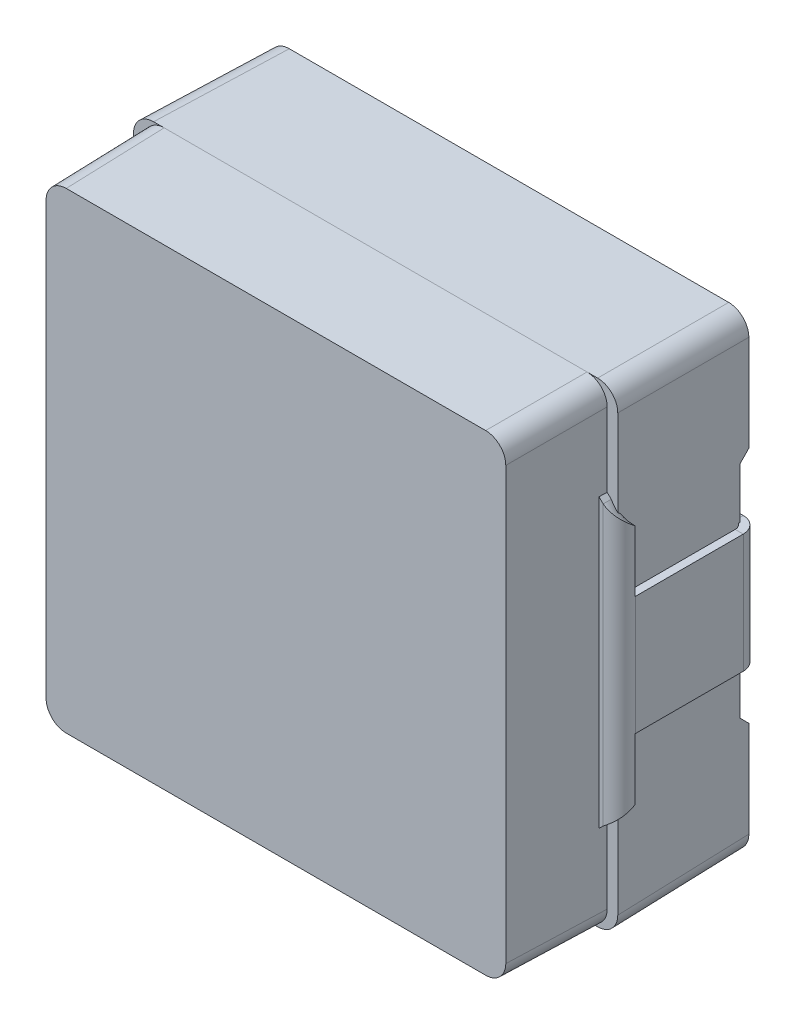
ISO-10303-21;
HEADER;
FILE_DESCRIPTION(('STEP AP214'),'2;1');
FILE_NAME('part.step','',(''),(''),'','','');
FILE_SCHEMA(('AUTOMOTIVE_DESIGN { 1 0 10303 214 1 1 1 1 }'));
ENDSEC;
DATA;
#1=APPLICATION_CONTEXT('core data for automotive mechanical design processes');
#2=APPLICATION_PROTOCOL_DEFINITION('international standard','automotive_design',2000,#1);
#3=PRODUCT_CONTEXT('',#1,'mechanical');
#4=PRODUCT('Part','Part','',(#3));
#5=PRODUCT_RELATED_PRODUCT_CATEGORY('part','',(#4));
#6=PRODUCT_DEFINITION_FORMATION('','',#4);
#7=PRODUCT_DEFINITION_CONTEXT('part definition',#1,'design');
#8=PRODUCT_DEFINITION('design','',#6,#7);
#9=PRODUCT_DEFINITION_SHAPE('','',#8);
#10=(LENGTH_UNIT() NAMED_UNIT(*) SI_UNIT(.MILLI.,.METRE.));
#11=(NAMED_UNIT(*) PLANE_ANGLE_UNIT() SI_UNIT($,.RADIAN.));
#12=(NAMED_UNIT(*) SI_UNIT($,.STERADIAN.) SOLID_ANGLE_UNIT());
#13=UNCERTAINTY_MEASURE_WITH_UNIT(LENGTH_MEASURE(1.E-05),#10,'distance_accuracy_value','');
#14=(GEOMETRIC_REPRESENTATION_CONTEXT(3) GLOBAL_UNCERTAINTY_ASSIGNED_CONTEXT((#13)) GLOBAL_UNIT_ASSIGNED_CONTEXT((#10,
#11,#12)) REPRESENTATION_CONTEXT('',''));
#15=CARTESIAN_POINT('',(0.,0.,0.));
#16=DIRECTION('',(0.,0.,1.));
#17=DIRECTION('',(1.,0.,0.));
#18=AXIS2_PLACEMENT_3D('',#15,#16,#17);
#19=CARTESIAN_POINT('',(-92.0369206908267,17.4887166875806,46.5732639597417));
#20=DIRECTION('',(1.,0.,0.));
#21=DIRECTION('',(0.,0.,1.));
#22=AXIS2_PLACEMENT_3D('',#19,#20,#21);
#23=PLANE('',#22);
#24=DIRECTION('',(0.,0.,1.));
#25=VECTOR('',#24,1.);
#26=CARTESIAN_POINT('',(-92.0369206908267,18.9873166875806,46.5732639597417));
#27=LINE('',#26,#25);
#28=CARTESIAN_POINT('',(-92.0369206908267,18.9873166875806,40.1508852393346));
#29=VERTEX_POINT('',#28);
#30=CARTESIAN_POINT('',(-92.0369206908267,18.9873166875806,37.4292639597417));
#31=VERTEX_POINT('',#30);
#32=EDGE_CURVE('P0_E33',#29,#31,#27,.F.);
#33=ORIENTED_EDGE('',*,*,#32,.T.);
#34=DIRECTION('',(0.,-1.,0.));
#35=VECTOR('',#34,1.);
#36=CARTESIAN_POINT('',(-92.0369206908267,17.4887166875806,37.4292639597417));
#37=LINE('',#36,#35);
#38=CARTESIAN_POINT('',(-92.0369206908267,15.9901166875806,37.4292639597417));
#39=VERTEX_POINT('',#38);
#40=EDGE_CURVE('P0_E25',#31,#39,#37,.T.);
#41=ORIENTED_EDGE('',*,*,#40,.T.);
#42=DIRECTION('',(0.,0.,1.));
#43=VECTOR('',#42,1.);
#44=CARTESIAN_POINT('',(-92.0369206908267,15.9901166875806,46.5732639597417));
#45=LINE('',#44,#43);
#46=CARTESIAN_POINT('',(-92.0369206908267,15.9901166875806,40.1508852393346));
#47=VERTEX_POINT('',#46);
#48=EDGE_CURVE('P0_E41',#47,#39,#45,.F.);
#49=ORIENTED_EDGE('',*,*,#48,.F.);
#50=DIRECTION('',(0.,1.,0.));
#51=VECTOR('',#50,1.);
#52=CARTESIAN_POINT('',(-92.0369206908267,17.4887166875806,40.1508852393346));
#53=LINE('',#52,#51);
#54=EDGE_CURVE('P0_E314',#47,#29,#53,.T.);
#55=ORIENTED_EDGE('',*,*,#54,.T.);
#56=EDGE_LOOP('',(#33,#41,#49,#55));
#57=FACE_BOUND('',#56,.T.);
#58=ADVANCED_FACE('P0_F16',(#57),#23,.F.);
#59=CARTESIAN_POINT('',(-104.330520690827,17.4887166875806,46.5732639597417));
#60=DIRECTION('',(-1.,0.,0.));
#61=DIRECTION('',(0.,0.,-1.));
#62=AXIS2_PLACEMENT_3D('',#59,#60,#61);
#63=PLANE('',#62);
#64=DIRECTION('',(0.,0.,-1.));
#65=VECTOR('',#64,1.);
#66=CARTESIAN_POINT('',(-104.330520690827,15.9901166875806,46.5732639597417));
#67=LINE('',#66,#65);
#68=CARTESIAN_POINT('',(-104.330520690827,15.9901166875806,37.4292639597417));
#69=VERTEX_POINT('',#68);
#70=CARTESIAN_POINT('',(-104.330520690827,15.9901166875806,40.1508852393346));
#71=VERTEX_POINT('',#70);
#72=EDGE_CURVE('P0_E1231',#69,#71,#67,.F.);
#73=ORIENTED_EDGE('',*,*,#72,.F.);
#74=DIRECTION('',(0.,1.,0.));
#75=VECTOR('',#74,1.);
#76=CARTESIAN_POINT('',(-104.330520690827,17.4887166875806,37.4292639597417));
#77=LINE('',#76,#75);
#78=CARTESIAN_POINT('',(-104.330520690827,18.9873166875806,37.4292639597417));
#79=VERTEX_POINT('',#78);
#80=EDGE_CURVE('P0_E1225',#69,#79,#77,.T.);
#81=ORIENTED_EDGE('',*,*,#80,.T.);
#82=DIRECTION('',(0.,0.,-1.));
#83=VECTOR('',#82,1.);
#84=CARTESIAN_POINT('',(-104.330520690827,18.9873166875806,46.5732639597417));
#85=LINE('',#84,#83);
#86=CARTESIAN_POINT('',(-104.330520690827,18.9873166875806,40.1508852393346));
#87=VERTEX_POINT('',#86);
#88=EDGE_CURVE('P0_E726',#79,#87,#85,.F.);
#89=ORIENTED_EDGE('',*,*,#88,.T.);
#90=DIRECTION('',(0.,1.,0.));
#91=VECTOR('',#90,1.);
#92=CARTESIAN_POINT('',(-104.330520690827,17.4887166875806,40.1508852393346));
#93=LINE('',#92,#91);
#94=EDGE_CURVE('P0_E737',#71,#87,#93,.T.);
#95=ORIENTED_EDGE('',*,*,#94,.F.);
#96=EDGE_LOOP('',(#73,#81,#89,#95));
#97=FACE_BOUND('',#96,.T.);
#98=ADVANCED_FACE('P0_F779',(#97),#63,.F.);
#99=CARTESIAN_POINT('',(-98.1837206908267,17.4887166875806,40.5572852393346));
#100=DIRECTION('',(0.,0.,1.));
#101=DIRECTION('',(-1.,0.,0.));
#102=AXIS2_PLACEMENT_3D('',#99,#100,#101);
#103=PLANE('',#102);
#104=DIRECTION('',(0.707106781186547,0.707106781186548,0.));
#105=VECTOR('',#104,1.);
#106=CARTESIAN_POINT('',(-93.4529706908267,12.7579666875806,40.5572852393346));
#107=LINE('',#106,#105);
#108=CARTESIAN_POINT('',(-92.5322206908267,13.6787166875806,40.5572852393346));
#109=VERTEX_POINT('',#108);
#110=CARTESIAN_POINT('',(-92.2401206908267,13.9708166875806,40.5572852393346));
#111=VERTEX_POINT('',#110);
#112=EDGE_CURVE('P0_E707',#109,#111,#107,.T.);
#113=ORIENTED_EDGE('',*,*,#112,.T.);
#114=DIRECTION('',(0.,1.,0.));
#115=VECTOR('',#114,1.);
#116=CARTESIAN_POINT('',(-92.2401206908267,17.4887166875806,40.5572852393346));
#117=LINE('',#116,#115);
#118=CARTESIAN_POINT('',(-92.2401206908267,21.0066166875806,40.5572852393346));
#119=VERTEX_POINT('',#118);
#120=EDGE_CURVE('P0_E743',#111,#119,#117,.T.);
#121=ORIENTED_EDGE('',*,*,#120,.T.);
#122=DIRECTION('',(0.707106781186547,-0.707106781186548,0.));
#123=VECTOR('',#122,1.);
#124=CARTESIAN_POINT('',(-93.4529706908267,22.2194666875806,40.5572852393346));
#125=LINE('',#124,#123);
#126=CARTESIAN_POINT('',(-92.5322206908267,21.2987166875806,40.5572852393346));
#127=VERTEX_POINT('',#126);
#128=EDGE_CURVE('P0_E1248',#127,#119,#125,.T.);
#129=ORIENTED_EDGE('',*,*,#128,.F.);
#130=DIRECTION('',(1.,0.,0.));
#131=VECTOR('',#130,1.);
#132=CARTESIAN_POINT('',(-98.1837206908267,21.2987166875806,40.5572852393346));
#133=LINE('',#132,#131);
#134=CARTESIAN_POINT('',(-103.835220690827,21.2987166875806,40.5572852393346));
#135=VERTEX_POINT('',#134);
#136=EDGE_CURVE('P0_E1270',#135,#127,#133,.T.);
#137=ORIENTED_EDGE('',*,*,#136,.F.);
#138=DIRECTION('',(0.707106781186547,0.707106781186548,0.));
#139=VECTOR('',#138,1.);
#140=CARTESIAN_POINT('',(-102.914470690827,22.2194666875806,40.5572852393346));
#141=LINE('',#140,#139);
#142=CARTESIAN_POINT('',(-104.127320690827,21.0066166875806,40.5572852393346));
#143=VERTEX_POINT('',#142);
#144=EDGE_CURVE('P0_E719',#143,#135,#141,.T.);
#145=ORIENTED_EDGE('',*,*,#144,.F.);
#146=DIRECTION('',(0.,1.,0.));
#147=VECTOR('',#146,1.);
#148=CARTESIAN_POINT('',(-104.127320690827,17.4887166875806,40.5572852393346));
#149=LINE('',#148,#147);
#150=CARTESIAN_POINT('',(-104.127320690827,13.9708166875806,40.5572852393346));
#151=VERTEX_POINT('',#150);
#152=EDGE_CURVE('P0_E1285',#151,#143,#149,.T.);
#153=ORIENTED_EDGE('',*,*,#152,.F.);
#154=DIRECTION('',(0.707106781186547,-0.707106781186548,0.));
#155=VECTOR('',#154,1.);
#156=CARTESIAN_POINT('',(-102.914470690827,12.7579666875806,40.5572852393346));
#157=LINE('',#156,#155);
#158=CARTESIAN_POINT('',(-103.835220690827,13.6787166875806,40.5572852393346));
#159=VERTEX_POINT('',#158);
#160=EDGE_CURVE('P0_E1280',#151,#159,#157,.T.);
#161=ORIENTED_EDGE('',*,*,#160,.T.);
#162=DIRECTION('',(1.,0.,0.));
#163=VECTOR('',#162,1.);
#164=CARTESIAN_POINT('',(-98.1837206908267,13.6787166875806,40.5572852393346));
#165=LINE('',#164,#163);
#166=EDGE_CURVE('P0_E1264',#159,#109,#165,.T.);
#167=ORIENTED_EDGE('',*,*,#166,.T.);
#168=EDGE_LOOP('',(#113,#121,#129,#137,#145,#153,#161,#167));
#169=FACE_BOUND('',#168,.T.);
#170=ADVANCED_FACE('P0_F776',(#169),#103,.T.);
#171=CARTESIAN_POINT('',(-93.4529706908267,12.7579666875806,40.5572852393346));
#172=DIRECTION('',(0.707106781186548,-0.707106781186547,0.));
#173=DIRECTION('',(0.707106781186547,0.707106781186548,0.));
#174=AXIS2_PLACEMENT_3D('',#171,#172,#173);
#175=PLANE('',#174);
#176=DIRECTION('',(0.707106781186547,0.707106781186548,0.));
#177=VECTOR('',#176,1.);
#178=CARTESIAN_POINT('',(-93.4529706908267,12.7579666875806,40.3540852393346));
#179=LINE('',#178,#177);
#180=CARTESIAN_POINT('',(-92.5322206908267,13.6787166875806,40.3540852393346));
#181=VERTEX_POINT('',#180);
#182=CARTESIAN_POINT('',(-92.2401206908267,13.9708166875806,40.3540852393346));
#183=VERTEX_POINT('',#182);
#184=EDGE_CURVE('P0_E1244',#181,#183,#179,.T.);
#185=ORIENTED_EDGE('',*,*,#184,.T.);
#186=CARTESIAN_POINT('',(-92.2401206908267,13.9708166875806,40.5572852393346));
#187=CARTESIAN_POINT('',(-92.2401206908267,13.9708166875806,40.3540852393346));
#188=B_SPLINE_CURVE_WITH_KNOTS('',1,(#186,#187),.UNSPECIFIED.,.F.,.F.,(2,2),(0.,1.),.UNSPECIFIED.);
#189=EDGE_CURVE('P0_E747',#183,#111,#188,.F.);
#190=ORIENTED_EDGE('',*,*,#189,.T.);
#191=ORIENTED_EDGE('',*,*,#112,.F.);
#192=DIRECTION('',(0.,0.,1.));
#193=VECTOR('',#192,1.);
#194=CARTESIAN_POINT('',(-92.5322206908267,13.6787166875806,40.5572852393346));
#195=LINE('',#194,#193);
#196=EDGE_CURVE('P0_E1282',#181,#109,#195,.T.);
#197=ORIENTED_EDGE('',*,*,#196,.F.);
#198=EDGE_LOOP('',(#185,#190,#191,#197));
#199=FACE_BOUND('',#198,.T.);
#200=ADVANCED_FACE('P0_F774',(#199),#175,.T.);
#201=CARTESIAN_POINT('',(-93.4529706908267,22.2194666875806,40.5572852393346));
#202=DIRECTION('',(-0.707106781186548,-0.707106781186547,0.));
#203=DIRECTION('',(0.707106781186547,-0.707106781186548,0.));
#204=AXIS2_PLACEMENT_3D('',#201,#202,#203);
#205=PLANE('',#204);
#206=ORIENTED_EDGE('',*,*,#128,.T.);
#207=CARTESIAN_POINT('',(-92.2401206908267,21.0066166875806,40.3540852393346));
#208=CARTESIAN_POINT('',(-92.2401206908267,21.0066166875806,40.5572852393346));
#209=B_SPLINE_CURVE_WITH_KNOTS('',1,(#207,#208),.UNSPECIFIED.,.F.,.F.,(2,2),(0.,1.),.UNSPECIFIED.);
#210=CARTESIAN_POINT('',(-92.2401206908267,21.0066166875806,40.3540852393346));
#211=VERTEX_POINT('',#210);
#212=EDGE_CURVE('P0_E746',#119,#211,#209,.F.);
#213=ORIENTED_EDGE('',*,*,#212,.T.);
#214=DIRECTION('',(0.707106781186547,-0.707106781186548,0.));
#215=VECTOR('',#214,1.);
#216=CARTESIAN_POINT('',(-93.4529706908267,22.2194666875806,40.3540852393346));
#217=LINE('',#216,#215);
#218=CARTESIAN_POINT('',(-92.5322206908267,21.2987166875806,40.3540852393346));
#219=VERTEX_POINT('',#218);
#220=EDGE_CURVE('P0_E727',#219,#211,#217,.T.);
#221=ORIENTED_EDGE('',*,*,#220,.F.);
#222=DIRECTION('',(0.,0.,1.));
#223=VECTOR('',#222,1.);
#224=CARTESIAN_POINT('',(-92.5322206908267,21.2987166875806,40.5572852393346));
#225=LINE('',#224,#223);
#226=EDGE_CURVE('P0_E1267',#219,#127,#225,.T.);
#227=ORIENTED_EDGE('',*,*,#226,.T.);
#228=EDGE_LOOP('',(#206,#213,#221,#227));
#229=FACE_BOUND('',#228,.T.);
#230=ADVANCED_FACE('P0_F764',(#229),#205,.F.);
#231=CARTESIAN_POINT('',(-104.533720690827,15.9901166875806,46.5732639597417));
#232=DIRECTION('',(0.,-1.,0.));
#233=DIRECTION('',(0.,0.,1.));
#234=AXIS2_PLACEMENT_3D('',#231,#232,#233);
#235=PLANE('',#234);
#236=DIRECTION('',(-1.,0.,0.));
#237=VECTOR('',#236,1.);
#238=CARTESIAN_POINT('',(-104.533720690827,15.9901166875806,37.4292639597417));
#239=LINE('',#238,#237);
#240=CARTESIAN_POINT('',(-104.533720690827,15.9901166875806,37.4292639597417));
#241=VERTEX_POINT('',#240);
#242=EDGE_CURVE('P0_E1215',#69,#241,#239,.T.);
#243=ORIENTED_EDGE('',*,*,#242,.F.);
#244=ORIENTED_EDGE('',*,*,#72,.T.);
#245=DIRECTION('',(-1.,0.,0.));
#246=VECTOR('',#245,1.);
#247=CARTESIAN_POINT('',(-104.533720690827,15.9901166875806,40.1508852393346));
#248=LINE('',#247,#246);
#249=CARTESIAN_POINT('',(-104.533720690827,15.9901166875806,40.1508852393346));
#250=VERTEX_POINT('',#249);
#251=EDGE_CURVE('P0_E733',#71,#250,#248,.T.);
#252=ORIENTED_EDGE('',*,*,#251,.T.);
#253=DIRECTION('',(0.,0.,1.));
#254=VECTOR('',#253,1.);
#255=CARTESIAN_POINT('',(-104.533720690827,15.9901166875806,46.5732639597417));
#256=LINE('',#255,#254);
#257=EDGE_CURVE('P0_E734',#241,#250,#256,.T.);
#258=ORIENTED_EDGE('',*,*,#257,.F.);
#259=EDGE_LOOP('',(#243,#244,#252,#258));
#260=FACE_BOUND('',#259,.T.);
#261=ADVANCED_FACE('P0_F773',(#260),#235,.T.);
#262=CARTESIAN_POINT('',(-104.533720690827,18.9873166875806,46.5732639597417));
#263=DIRECTION('',(0.,-1.,0.));
#264=DIRECTION('',(0.,0.,1.));
#265=AXIS2_PLACEMENT_3D('',#262,#263,#264);
#266=PLANE('',#265);
#267=DIRECTION('',(1.,0.,0.));
#268=VECTOR('',#267,1.);
#269=CARTESIAN_POINT('',(-104.533720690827,18.9873166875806,37.4292639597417));
#270=LINE('',#269,#268);
#271=CARTESIAN_POINT('',(-104.533720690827,18.9873166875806,37.4292639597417));
#272=VERTEX_POINT('',#271);
#273=EDGE_CURVE('P0_E1236',#272,#79,#270,.T.);
#274=ORIENTED_EDGE('',*,*,#273,.F.);
#275=DIRECTION('',(0.,0.,1.));
#276=VECTOR('',#275,1.);
#277=CARTESIAN_POINT('',(-104.533720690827,18.9873166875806,46.5732639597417));
#278=LINE('',#277,#276);
#279=CARTESIAN_POINT('',(-104.533720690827,18.9873166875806,40.1508852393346));
#280=VERTEX_POINT('',#279);
#281=EDGE_CURVE('P0_E1229',#272,#280,#278,.T.);
#282=ORIENTED_EDGE('',*,*,#281,.T.);
#283=DIRECTION('',(1.,0.,0.));
#284=VECTOR('',#283,1.);
#285=CARTESIAN_POINT('',(-104.533720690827,18.9873166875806,40.1508852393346));
#286=LINE('',#285,#284);
#287=EDGE_CURVE('P0_E740',#280,#87,#286,.T.);
#288=ORIENTED_EDGE('',*,*,#287,.T.);
#289=ORIENTED_EDGE('',*,*,#88,.F.);
#290=EDGE_LOOP('',(#274,#282,#288,#289));
#291=FACE_BOUND('',#290,.T.);
#292=ADVANCED_FACE('P0_F786',(#291),#266,.F.);
#293=CARTESIAN_POINT('',(-104.533720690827,17.4887166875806,46.5732639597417));
#294=DIRECTION('',(-1.,0.,0.));
#295=DIRECTION('',(0.,0.,-1.));
#296=AXIS2_PLACEMENT_3D('',#293,#294,#295);
#297=PLANE('',#296);
#298=DIRECTION('',(0.,1.,0.));
#299=VECTOR('',#298,1.);
#300=CARTESIAN_POINT('',(-104.533720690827,17.4887166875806,37.4292639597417));
#301=LINE('',#300,#299);
#302=EDGE_CURVE('P0_E1239',#241,#272,#301,.T.);
#303=ORIENTED_EDGE('',*,*,#302,.F.);
#304=ORIENTED_EDGE('',*,*,#257,.T.);
#305=DIRECTION('',(0.,1.,0.));
#306=VECTOR('',#305,1.);
#307=CARTESIAN_POINT('',(-104.533720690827,17.4887166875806,40.1508852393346));
#308=LINE('',#307,#306);
#309=EDGE_CURVE('P0_E730',#250,#280,#308,.T.);
#310=ORIENTED_EDGE('',*,*,#309,.T.);
#311=ORIENTED_EDGE('',*,*,#281,.F.);
#312=EDGE_LOOP('',(#303,#304,#310,#311));
#313=FACE_BOUND('',#312,.T.);
#314=ADVANCED_FACE('P0_F674',(#313),#297,.T.);
#315=CARTESIAN_POINT('',(-98.1837206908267,21.2987166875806,40.5572852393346));
#316=DIRECTION('',(0.,-1.,0.));
#317=DIRECTION('',(1.,0.,0.));
#318=AXIS2_PLACEMENT_3D('',#315,#316,#317);
#319=PLANE('',#318);
#320=ORIENTED_EDGE('',*,*,#226,.F.);
#321=DIRECTION('',(-1.,0.,0.));
#322=VECTOR('',#321,1.);
#323=CARTESIAN_POINT('',(-98.1837206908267,21.2987166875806,40.3540852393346));
#324=LINE('',#323,#322);
#325=CARTESIAN_POINT('',(-103.835220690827,21.2987166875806,40.3540852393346));
#326=VERTEX_POINT('',#325);
#327=EDGE_CURVE('P0_E711',#326,#219,#324,.F.);
#328=ORIENTED_EDGE('',*,*,#327,.F.);
#329=DIRECTION('',(0.,0.,1.));
#330=VECTOR('',#329,1.);
#331=CARTESIAN_POINT('',(-103.835220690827,21.2987166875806,40.5572852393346));
#332=LINE('',#331,#330);
#333=EDGE_CURVE('P0_E1273',#326,#135,#332,.T.);
#334=ORIENTED_EDGE('',*,*,#333,.T.);
#335=ORIENTED_EDGE('',*,*,#136,.T.);
#336=EDGE_LOOP('',(#320,#328,#334,#335));
#337=FACE_BOUND('',#336,.T.);
#338=ADVANCED_FACE('P0_F670',(#337),#319,.F.);
#339=CARTESIAN_POINT('',(-98.1837206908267,13.6787166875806,40.5572852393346));
#340=DIRECTION('',(0.,-1.,0.));
#341=DIRECTION('',(1.,0.,0.));
#342=AXIS2_PLACEMENT_3D('',#339,#340,#341);
#343=PLANE('',#342);
#344=DIRECTION('',(0.,0.,1.));
#345=VECTOR('',#344,1.);
#346=CARTESIAN_POINT('',(-103.835220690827,13.6787166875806,40.5572852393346));
#347=LINE('',#346,#345);
#348=CARTESIAN_POINT('',(-103.835220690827,13.6787166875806,40.3540852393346));
#349=VERTEX_POINT('',#348);
#350=EDGE_CURVE('P0_E702',#349,#159,#347,.T.);
#351=ORIENTED_EDGE('',*,*,#350,.F.);
#352=DIRECTION('',(-1.,0.,0.));
#353=VECTOR('',#352,1.);
#354=CARTESIAN_POINT('',(-98.1837206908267,13.6787166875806,40.3540852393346));
#355=LINE('',#354,#353);
#356=EDGE_CURVE('P0_E1247',#349,#181,#355,.F.);
#357=ORIENTED_EDGE('',*,*,#356,.T.);
#358=ORIENTED_EDGE('',*,*,#196,.T.);
#359=ORIENTED_EDGE('',*,*,#166,.F.);
#360=EDGE_LOOP('',(#351,#357,#358,#359));
#361=FACE_BOUND('',#360,.T.);
#362=ADVANCED_FACE('P0_F673',(#361),#343,.T.);
#363=CARTESIAN_POINT('',(-102.914470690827,12.7579666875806,40.5572852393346));
#364=DIRECTION('',(-0.707106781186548,-0.707106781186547,0.));
#365=DIRECTION('',(0.707106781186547,-0.707106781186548,0.));
#366=AXIS2_PLACEMENT_3D('',#363,#364,#365);
#367=PLANE('',#366);
#368=CARTESIAN_POINT('',(-104.127320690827,13.9708166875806,40.3540852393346));
#369=CARTESIAN_POINT('',(-104.127320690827,13.9708166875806,40.5572852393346));
#370=B_SPLINE_CURVE_WITH_KNOTS('',1,(#368,#369),.UNSPECIFIED.,.F.,.F.,(2,2),(0.,1.),.UNSPECIFIED.);
#371=CARTESIAN_POINT('',(-104.127320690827,13.9708166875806,40.3540852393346));
#372=VERTEX_POINT('',#371);
#373=EDGE_CURVE('P0_E633',#372,#151,#370,.T.);
#374=ORIENTED_EDGE('',*,*,#373,.F.);
#375=DIRECTION('',(0.707106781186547,-0.707106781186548,0.));
#376=VECTOR('',#375,1.);
#377=CARTESIAN_POINT('',(-102.914470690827,12.7579666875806,40.3540852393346));
#378=LINE('',#377,#376);
#379=EDGE_CURVE('P0_E705',#372,#349,#378,.T.);
#380=ORIENTED_EDGE('',*,*,#379,.T.);
#381=ORIENTED_EDGE('',*,*,#350,.T.);
#382=ORIENTED_EDGE('',*,*,#160,.F.);
#383=EDGE_LOOP('',(#374,#380,#381,#382));
#384=FACE_BOUND('',#383,.T.);
#385=ADVANCED_FACE('P0_F678',(#384),#367,.T.);
#386=CARTESIAN_POINT('',(-98.1837206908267,17.4887166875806,40.3540852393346));
#387=DIRECTION('',(0.,0.,1.));
#388=DIRECTION('',(-1.,0.,0.));
#389=AXIS2_PLACEMENT_3D('',#386,#387,#388);
#390=PLANE('',#389);
#391=DIRECTION('',(0.,1.,0.));
#392=VECTOR('',#391,1.);
#393=CARTESIAN_POINT('',(-92.2401206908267,17.4887166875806,40.3540852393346));
#394=LINE('',#393,#392);
#395=EDGE_CURVE('P0_E744',#183,#211,#394,.T.);
#396=ORIENTED_EDGE('',*,*,#395,.F.);
#397=ORIENTED_EDGE('',*,*,#184,.F.);
#398=ORIENTED_EDGE('',*,*,#356,.F.);
#399=ORIENTED_EDGE('',*,*,#379,.F.);
#400=DIRECTION('',(0.,1.,0.));
#401=VECTOR('',#400,1.);
#402=CARTESIAN_POINT('',(-104.127320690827,17.4887166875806,40.3540852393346));
#403=LINE('',#402,#401);
#404=CARTESIAN_POINT('',(-104.127320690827,21.0066166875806,40.3540852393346));
#405=VERTEX_POINT('',#404);
#406=EDGE_CURVE('P0_E693',#372,#405,#403,.T.);
#407=ORIENTED_EDGE('',*,*,#406,.T.);
#408=DIRECTION('',(0.707106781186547,0.707106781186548,0.));
#409=VECTOR('',#408,1.);
#410=CARTESIAN_POINT('',(-102.914470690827,22.2194666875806,40.3540852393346));
#411=LINE('',#410,#409);
#412=EDGE_CURVE('P0_E701',#405,#326,#411,.T.);
#413=ORIENTED_EDGE('',*,*,#412,.T.);
#414=ORIENTED_EDGE('',*,*,#327,.T.);
#415=ORIENTED_EDGE('',*,*,#220,.T.);
#416=EDGE_LOOP('',(#396,#397,#398,#399,#407,#413,#414,#415));
#417=FACE_BOUND('',#416,.T.);
#418=ADVANCED_FACE('P0_F683',(#417),#390,.F.);
#419=CARTESIAN_POINT('',(-102.914470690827,22.2194666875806,40.5572852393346));
#420=DIRECTION('',(0.707106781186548,-0.707106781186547,0.));
#421=DIRECTION('',(0.707106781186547,0.707106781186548,0.));
#422=AXIS2_PLACEMENT_3D('',#419,#420,#421);
#423=PLANE('',#422);
#424=CARTESIAN_POINT('',(-104.127320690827,21.0066166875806,40.5572852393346));
#425=CARTESIAN_POINT('',(-104.127320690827,21.0066166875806,40.3540852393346));
#426=B_SPLINE_CURVE_WITH_KNOTS('',1,(#424,#425),.UNSPECIFIED.,.F.,.F.,(2,2),(0.,1.),.UNSPECIFIED.);
#427=EDGE_CURVE('P0_E618',#143,#405,#426,.T.);
#428=ORIENTED_EDGE('',*,*,#427,.F.);
#429=ORIENTED_EDGE('',*,*,#144,.T.);
#430=ORIENTED_EDGE('',*,*,#333,.F.);
#431=ORIENTED_EDGE('',*,*,#412,.F.);
#432=EDGE_LOOP('',(#428,#429,#430,#431));
#433=FACE_BOUND('',#432,.T.);
#434=ADVANCED_FACE('P0_F665',(#433),#423,.F.);
#435=CARTESIAN_POINT('',(-104.127320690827,15.9901166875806,40.1508852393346));
#436=DIRECTION('',(0.,-1.,0.));
#437=DIRECTION('',(0.,0.,1.));
#438=AXIS2_PLACEMENT_3D('',#435,#436,#437);
#439=PLANE('',#438);
#440=ORIENTED_EDGE('',*,*,#251,.F.);
#441=CARTESIAN_POINT('',(-104.127320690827,15.9901166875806,40.1508852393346));
#442=DIRECTION('',(0.,-1.,0.));
#443=DIRECTION('',(1.,0.,0.));
#444=AXIS2_PLACEMENT_3D('',#441,#442,#443);
#445=CIRCLE('',#444,0.2032);
#446=CARTESIAN_POINT('',(-104.330434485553,15.9901166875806,40.1568035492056));
#447=VERTEX_POINT('',#446);
#448=EDGE_CURVE('P0_E470',#71,#447,#445,.F.);
#449=ORIENTED_EDGE('',*,*,#448,.T.);
#450=DIRECTION('',(-0.999575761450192,0.,0.0291255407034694));
#451=VECTOR('',#450,1.);
#452=CARTESIAN_POINT('',(-104.53354828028,15.9901166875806,40.1627218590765));
#453=LINE('',#452,#451);
#454=CARTESIAN_POINT('',(-104.53354828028,15.9901166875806,40.1627218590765));
#455=VERTEX_POINT('',#454);
#456=EDGE_CURVE('P0_E1286',#447,#455,#453,.T.);
#457=ORIENTED_EDGE('',*,*,#456,.T.);
#458=CARTESIAN_POINT('',(-104.127320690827,15.9901166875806,40.1508852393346));
#459=DIRECTION('',(0.,1.,0.));
#460=DIRECTION('',(0.,0.,-1.));
#461=AXIS2_PLACEMENT_3D('',#458,#459,#460);
#462=CIRCLE('',#461,0.4064);
#463=EDGE_CURVE('P0_E493',#250,#455,#462,.T.);
#464=ORIENTED_EDGE('',*,*,#463,.F.);
#465=EDGE_LOOP('',(#440,#449,#457,#464));
#466=FACE_BOUND('',#465,.T.);
#467=ADVANCED_FACE('P0_F662',(#466),#439,.T.);
#468=CARTESIAN_POINT('',(-104.53354828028,15.2154166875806,40.1627218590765));
#469=DIRECTION('',(-0.0291255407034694,0.,-0.999575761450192));
#470=DIRECTION('',(0.,-1.,0.));
#471=AXIS2_PLACEMENT_3D('',#468,#469,#470);
#472=PLANE('',#471);
#473=ORIENTED_EDGE('',*,*,#456,.F.);
#474=DIRECTION('',(0.,-1.,0.));
#475=VECTOR('',#474,1.);
#476=CARTESIAN_POINT('',(-104.330434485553,24.5437149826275,40.1568035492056));
#477=LINE('',#476,#475);
#478=CARTESIAN_POINT('',(-104.330434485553,14.4407166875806,40.1568035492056));
#479=VERTEX_POINT('',#478);
#480=EDGE_CURVE('P0_E1315',#447,#479,#477,.T.);
#481=ORIENTED_EDGE('',*,*,#480,.T.);
#482=CARTESIAN_POINT('',(-104.53354828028,14.4407166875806,40.1627218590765));
#483=CARTESIAN_POINT('',(-104.330434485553,14.4407166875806,40.1568035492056));
#484=B_SPLINE_CURVE_WITH_KNOTS('',1,(#482,#483),.UNSPECIFIED.,.F.,.F.,(2,2),(0.,1.),.UNSPECIFIED.);
#485=CARTESIAN_POINT('',(-104.53354828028,14.4407166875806,40.1627218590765));
#486=VERTEX_POINT('',#485);
#487=EDGE_CURVE('P0_E647',#479,#486,#484,.F.);
#488=ORIENTED_EDGE('',*,*,#487,.T.);
#489=DIRECTION('',(0.,-1.,0.));
#490=VECTOR('',#489,1.);
#491=CARTESIAN_POINT('',(-104.53354828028,15.9901166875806,40.1627218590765));
#492=LINE('',#491,#490);
#493=EDGE_CURVE('P0_E1347',#455,#486,#492,.T.);
#494=ORIENTED_EDGE('',*,*,#493,.F.);
#495=EDGE_LOOP('',(#473,#481,#488,#494));
#496=FACE_BOUND('',#495,.T.);
#497=ADVANCED_FACE('P0_F653',(#496),#472,.T.);
#498=CARTESIAN_POINT('',(-104.53354828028,14.4407166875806,40.1627218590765));
#499=CARTESIAN_POINT('',(-104.530501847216,14.3622692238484,40.2672741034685));
#500=CARTESIAN_POINT('',(-104.485378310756,14.2840833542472,40.3696538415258));
#501=CARTESIAN_POINT('',(-104.33556786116,14.1274500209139,40.5151627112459));
#502=CARTESIAN_POINT('',(-104.231917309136,14.0492641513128,40.5572852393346));
#503=CARTESIAN_POINT('',(-104.127320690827,13.9708166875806,40.5572852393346));
#504=CARTESIAN_POINT('',(-104.330434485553,14.4407166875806,40.1568035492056));
#505=CARTESIAN_POINT('',(-104.328912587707,14.3623371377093,40.209034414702));
#506=CARTESIAN_POINT('',(-104.306349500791,14.2840833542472,40.2602695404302));
#507=CARTESIAN_POINT('',(-104.231444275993,14.1274500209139,40.3330239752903));
#508=CARTESIAN_POINT('',(-104.179573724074,14.0491962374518,40.3540852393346));
#509=CARTESIAN_POINT('',(-104.127320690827,13.9708166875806,40.3540852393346));
#510=B_SPLINE_SURFACE_WITH_KNOTS('',1,3,((#498,#499,#500,#501,#502,#503),(#504,#505,#506,#507,
#508,#509)),.UNSPECIFIED.,.F.,.F.,.F.,(2,2),(4,2,4),(0.,1.),(0.,0.5,1.),.UNSPECIFIED.);
#511=CARTESIAN_POINT('',(-104.330434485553,14.4407166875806,40.1568035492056));
#512=CARTESIAN_POINT('',(-104.328912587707,14.3623371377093,40.209034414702));
#513=CARTESIAN_POINT('',(-104.306349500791,14.2840833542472,40.2602695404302));
#514=CARTESIAN_POINT('',(-104.231444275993,14.1274500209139,40.3330239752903));
#515=CARTESIAN_POINT('',(-104.179573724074,14.0491962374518,40.3540852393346));
#516=CARTESIAN_POINT('',(-104.127320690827,13.9708166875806,40.3540852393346));
#517=B_SPLINE_CURVE_WITH_KNOTS('',3,(#511,#512,#513,#514,#515,#516),.UNSPECIFIED.,.F.,.F.,(4,2,
4),(0.,0.5,1.),.UNSPECIFIED.);
#518=EDGE_CURVE('P0_E1312',#479,#372,#517,.T.);
#519=CARTESIAN_POINT('',(-104.127320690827,13.9708166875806,40.5572852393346));
#520=CARTESIAN_POINT('',(-104.231917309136,14.0492641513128,40.5572852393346));
#521=CARTESIAN_POINT('',(-104.33556786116,14.1274500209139,40.5151627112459));
#522=CARTESIAN_POINT('',(-104.485378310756,14.2840833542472,40.3696538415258));
#523=CARTESIAN_POINT('',(-104.530501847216,14.3622692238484,40.2672741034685));
#524=CARTESIAN_POINT('',(-104.53354828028,14.4407166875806,40.1627218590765));
#525=B_SPLINE_CURVE_WITH_KNOTS('',3,(#519,#520,#521,#522,#523,#524),.UNSPECIFIED.,.F.,.F.,(4,2,
4),(0.,0.5,1.),.UNSPECIFIED.);
#526=EDGE_CURVE('P0_E1333',#486,#151,#525,.F.);
#527=ORIENTED_EDGE('',*,*,#487,.F.);
#528=ORIENTED_EDGE('',*,*,#518,.T.);
#529=ORIENTED_EDGE('',*,*,#373,.T.);
#530=ORIENTED_EDGE('',*,*,#526,.F.);
#531=EDGE_LOOP('',(#527,#528,#529,#530));
#532=FACE_BOUND('',#531,.T.);
#533=ADVANCED_FACE('P0_F577',(#532),#510,.T.);
#534=CARTESIAN_POINT('',(-104.127320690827,21.0066166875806,40.5572852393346));
#535=CARTESIAN_POINT('',(-104.231917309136,20.9281692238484,40.5572852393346));
#536=CARTESIAN_POINT('',(-104.33556786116,20.8499833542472,40.5151627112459));
#537=CARTESIAN_POINT('',(-104.485378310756,20.6933500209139,40.3696538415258));
#538=CARTESIAN_POINT('',(-104.530501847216,20.6151641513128,40.2672741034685));
#539=CARTESIAN_POINT('',(-104.53354828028,20.5367166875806,40.1627218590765));
#540=CARTESIAN_POINT('',(-104.127320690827,21.0066166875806,40.3540852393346));
#541=CARTESIAN_POINT('',(-104.179573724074,20.9282371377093,40.3540852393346));
#542=CARTESIAN_POINT('',(-104.231444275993,20.8499833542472,40.3330239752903));
#543=CARTESIAN_POINT('',(-104.306349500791,20.6933500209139,40.2602695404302));
#544=CARTESIAN_POINT('',(-104.328912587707,20.6150962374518,40.209034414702));
#545=CARTESIAN_POINT('',(-104.330434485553,20.5367166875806,40.1568035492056));
#546=B_SPLINE_SURFACE_WITH_KNOTS('',1,3,((#534,#535,#536,#537,#538,#539),(#540,#541,#542,#543,
#544,#545)),.UNSPECIFIED.,.F.,.F.,.F.,(2,2),(4,2,4),(0.,1.),(0.,0.5,1.),.UNSPECIFIED.);
#547=CARTESIAN_POINT('',(-104.127320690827,21.0066166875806,40.3540852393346));
#548=CARTESIAN_POINT('',(-104.179573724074,20.9282371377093,40.3540852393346));
#549=CARTESIAN_POINT('',(-104.231444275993,20.8499833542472,40.3330239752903));
#550=CARTESIAN_POINT('',(-104.306349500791,20.6933500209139,40.2602695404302));
#551=CARTESIAN_POINT('',(-104.328912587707,20.6150962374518,40.209034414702));
#552=CARTESIAN_POINT('',(-104.330434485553,20.5367166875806,40.1568035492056));
#553=B_SPLINE_CURVE_WITH_KNOTS('',3,(#547,#548,#549,#550,#551,#552),.UNSPECIFIED.,.F.,.F.,(4,2,
4),(0.,0.5,1.),.UNSPECIFIED.);
#554=CARTESIAN_POINT('',(-104.330434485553,20.5367166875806,40.1568035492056));
#555=VERTEX_POINT('',#554);
#556=EDGE_CURVE('P0_E549',#405,#555,#553,.T.);
#557=CARTESIAN_POINT('',(-104.330434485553,20.5367166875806,40.1568035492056));
#558=CARTESIAN_POINT('',(-104.53354828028,20.5367166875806,40.1627218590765));
#559=B_SPLINE_CURVE_WITH_KNOTS('',1,(#557,#558),.UNSPECIFIED.,.F.,.F.,(2,2),(0.,1.),.UNSPECIFIED.);
#560=CARTESIAN_POINT('',(-104.53354828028,20.5367166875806,40.1627218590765));
#561=VERTEX_POINT('',#560);
#562=EDGE_CURVE('P0_E608',#555,#561,#559,.T.);
#563=CARTESIAN_POINT('',(-104.53354828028,20.5367166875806,40.1627218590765));
#564=CARTESIAN_POINT('',(-104.530501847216,20.6151641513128,40.2672741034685));
#565=CARTESIAN_POINT('',(-104.485378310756,20.6933500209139,40.3696538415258));
#566=CARTESIAN_POINT('',(-104.33556786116,20.8499833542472,40.5151627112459));
#567=CARTESIAN_POINT('',(-104.231917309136,20.9281692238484,40.5572852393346));
#568=CARTESIAN_POINT('',(-104.127320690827,21.0066166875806,40.5572852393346));
#569=B_SPLINE_CURVE_WITH_KNOTS('',3,(#563,#564,#565,#566,#567,#568),.UNSPECIFIED.,.F.,.F.,(4,2,
4),(0.,0.5,1.),.UNSPECIFIED.);
#570=EDGE_CURVE('P0_E540',#143,#561,#569,.F.);
#571=ORIENTED_EDGE('',*,*,#427,.T.);
#572=ORIENTED_EDGE('',*,*,#556,.T.);
#573=ORIENTED_EDGE('',*,*,#562,.T.);
#574=ORIENTED_EDGE('',*,*,#570,.F.);
#575=EDGE_LOOP('',(#571,#572,#573,#574));
#576=FACE_BOUND('',#575,.T.);
#577=ADVANCED_FACE('P0_F565',(#576),#546,.T.);
#578=CARTESIAN_POINT('',(-104.53354828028,19.7620166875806,40.1627218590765));
#579=DIRECTION('',(-0.0291255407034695,0.,-0.999575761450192));
#580=DIRECTION('',(0.,-1.,0.));
#581=AXIS2_PLACEMENT_3D('',#578,#579,#580);
#582=PLANE('',#581);
#583=ORIENTED_EDGE('',*,*,#562,.F.);
#584=DIRECTION('',(0.,-1.,0.));
#585=VECTOR('',#584,1.);
#586=CARTESIAN_POINT('',(-104.330434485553,24.5437149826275,40.1568035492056));
#587=LINE('',#586,#585);
#588=CARTESIAN_POINT('',(-104.330434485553,18.9873166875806,40.1568035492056));
#589=VERTEX_POINT('',#588);
#590=EDGE_CURVE('P0_E1356',#555,#589,#587,.T.);
#591=ORIENTED_EDGE('',*,*,#590,.T.);
#592=DIRECTION('',(-0.999575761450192,0.,0.0291255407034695));
#593=VECTOR('',#592,1.);
#594=CARTESIAN_POINT('',(-104.53354828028,18.9873166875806,40.1627218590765));
#595=LINE('',#594,#593);
#596=CARTESIAN_POINT('',(-104.53354828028,18.9873166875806,40.1627218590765));
#597=VERTEX_POINT('',#596);
#598=EDGE_CURVE('P0_E1296',#589,#597,#595,.T.);
#599=ORIENTED_EDGE('',*,*,#598,.T.);
#600=DIRECTION('',(0.,-1.,0.));
#601=VECTOR('',#600,1.);
#602=CARTESIAN_POINT('',(-104.53354828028,20.5367166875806,40.1627218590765));
#603=LINE('',#602,#601);
#604=EDGE_CURVE('P0_E527',#561,#597,#603,.T.);
#605=ORIENTED_EDGE('',*,*,#604,.F.);
#606=EDGE_LOOP('',(#583,#591,#599,#605));
#607=FACE_BOUND('',#606,.T.);
#608=ADVANCED_FACE('P0_F576',(#607),#582,.T.);
#609=CARTESIAN_POINT('',(-104.127320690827,18.9873166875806,40.1508852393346));
#610=DIRECTION('',(0.,1.,0.));
#611=DIRECTION('',(0.,0.,-1.));
#612=AXIS2_PLACEMENT_3D('',#609,#610,#611);
#613=PLANE('',#612);
#614=CARTESIAN_POINT('',(-104.127320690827,18.9873166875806,40.1508852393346));
#615=DIRECTION('',(0.,-1.,0.));
#616=DIRECTION('',(1.,0.,0.));
#617=AXIS2_PLACEMENT_3D('',#614,#615,#616);
#618=CIRCLE('',#617,0.2032);
#619=EDGE_CURVE('P0_E1354',#589,#87,#618,.T.);
#620=ORIENTED_EDGE('',*,*,#619,.T.);
#621=ORIENTED_EDGE('',*,*,#287,.F.);
#622=CARTESIAN_POINT('',(-104.127320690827,18.9873166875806,40.1508852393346));
#623=DIRECTION('',(0.,-1.,0.));
#624=DIRECTION('',(0.,0.,-1.));
#625=AXIS2_PLACEMENT_3D('',#622,#623,#624);
#626=CIRCLE('',#625,0.4064);
#627=EDGE_CURVE('P0_E1298',#597,#280,#626,.T.);
#628=ORIENTED_EDGE('',*,*,#627,.F.);
#629=ORIENTED_EDGE('',*,*,#598,.F.);
#630=EDGE_LOOP('',(#620,#621,#628,#629));
#631=FACE_BOUND('',#630,.T.);
#632=ADVANCED_FACE('P0_F510',(#631),#613,.T.);
#633=CARTESIAN_POINT('',(-104.127320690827,24.5437149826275,40.1508852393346));
#634=DIRECTION('',(0.,-1.,0.));
#635=DIRECTION('',(1.,0.,0.));
#636=AXIS2_PLACEMENT_3D('',#633,#634,#635);
#637=CYLINDRICAL_SURFACE('',#636,0.4064);
#638=ORIENTED_EDGE('',*,*,#604,.T.);
#639=ORIENTED_EDGE('',*,*,#627,.T.);
#640=ORIENTED_EDGE('',*,*,#309,.F.);
#641=ORIENTED_EDGE('',*,*,#463,.T.);
#642=ORIENTED_EDGE('',*,*,#493,.T.);
#643=ORIENTED_EDGE('',*,*,#526,.T.);
#644=ORIENTED_EDGE('',*,*,#152,.T.);
#645=ORIENTED_EDGE('',*,*,#570,.T.);
#646=EDGE_LOOP('',(#638,#639,#640,#641,#642,#643,#644,#645));
#647=FACE_BOUND('',#646,.T.);
#648=ADVANCED_FACE('P0_F505',(#647),#637,.T.);
#649=CARTESIAN_POINT('',(-104.127320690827,24.5437149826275,40.1508852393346));
#650=DIRECTION('',(0.,-1.,0.));
#651=DIRECTION('',(1.,0.,0.));
#652=AXIS2_PLACEMENT_3D('',#649,#650,#651);
#653=CYLINDRICAL_SURFACE('',#652,0.2032);
#654=ORIENTED_EDGE('',*,*,#590,.F.);
#655=ORIENTED_EDGE('',*,*,#556,.F.);
#656=ORIENTED_EDGE('',*,*,#406,.F.);
#657=ORIENTED_EDGE('',*,*,#518,.F.);
#658=ORIENTED_EDGE('',*,*,#480,.F.);
#659=ORIENTED_EDGE('',*,*,#448,.F.);
#660=ORIENTED_EDGE('',*,*,#94,.T.);
#661=ORIENTED_EDGE('',*,*,#619,.F.);
#662=EDGE_LOOP('',(#654,#655,#656,#657,#658,#659,#660,#661));
#663=FACE_BOUND('',#662,.T.);
#664=ADVANCED_FACE('P0_F509',(#663),#653,.F.);
#665=CARTESIAN_POINT('',(-92.2401206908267,15.9901166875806,40.1508852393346));
#666=DIRECTION('',(0.,-1.,0.));
#667=DIRECTION('',(0.,0.,1.));
#668=AXIS2_PLACEMENT_3D('',#665,#666,#667);
#669=PLANE('',#668);
#670=DIRECTION('',(0.999575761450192,0.,0.0291255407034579));
#671=VECTOR('',#670,1.);
#672=CARTESIAN_POINT('',(-91.8338931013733,15.9901166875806,40.1627218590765));
#673=LINE('',#672,#671);
#674=CARTESIAN_POINT('',(-92.0370068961,15.9901166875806,40.1568035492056));
#675=VERTEX_POINT('',#674);
#676=CARTESIAN_POINT('',(-91.8338931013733,15.9901166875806,40.1627218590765));
#677=VERTEX_POINT('',#676);
#678=EDGE_CURVE('P0_E468',#675,#677,#673,.T.);
#679=ORIENTED_EDGE('',*,*,#678,.F.);
#680=CARTESIAN_POINT('',(-92.2401206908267,15.9901166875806,40.1508852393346));
#681=DIRECTION('',(0.,1.,0.));
#682=DIRECTION('',(-1.,0.,0.));
#683=AXIS2_PLACEMENT_3D('',#680,#681,#682);
#684=CIRCLE('',#683,0.2032);
#685=EDGE_CURVE('P0_E1209',#675,#47,#684,.T.);
#686=ORIENTED_EDGE('',*,*,#685,.T.);
#687=DIRECTION('',(1.,0.,0.));
#688=VECTOR('',#687,1.);
#689=CARTESIAN_POINT('',(-91.8337206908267,15.9901166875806,40.1508852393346));
#690=LINE('',#689,#688);
#691=CARTESIAN_POINT('',(-91.8337206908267,15.9901166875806,40.1508852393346));
#692=VERTEX_POINT('',#691);
#693=EDGE_CURVE('P0_E316',#47,#692,#690,.T.);
#694=ORIENTED_EDGE('',*,*,#693,.T.);
#695=CARTESIAN_POINT('',(-92.2401206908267,15.9901166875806,40.1508852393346));
#696=DIRECTION('',(0.,1.,0.));
#697=DIRECTION('',(0.,0.,-1.));
#698=AXIS2_PLACEMENT_3D('',#695,#696,#697);
#699=CIRCLE('',#698,0.4064);
#700=EDGE_CURVE('P0_E324',#677,#692,#699,.T.);
#701=ORIENTED_EDGE('',*,*,#700,.F.);
#702=EDGE_LOOP('',(#679,#686,#694,#701));
#703=FACE_BOUND('',#702,.T.);
#704=ADVANCED_FACE('P0_F504',(#703),#669,.T.);
#705=CARTESIAN_POINT('',(-92.2401206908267,18.9873166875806,40.1508852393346));
#706=DIRECTION('',(0.,1.,0.));
#707=DIRECTION('',(0.,0.,-1.));
#708=AXIS2_PLACEMENT_3D('',#705,#706,#707);
#709=PLANE('',#708);
#710=DIRECTION('',(-1.,0.,0.));
#711=VECTOR('',#710,1.);
#712=CARTESIAN_POINT('',(-91.8337206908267,18.9873166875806,40.1508852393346));
#713=LINE('',#712,#711);
#714=CARTESIAN_POINT('',(-91.8337206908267,18.9873166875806,40.1508852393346));
#715=VERTEX_POINT('',#714);
#716=EDGE_CURVE('P0_E319',#715,#29,#713,.T.);
#717=ORIENTED_EDGE('',*,*,#716,.T.);
#718=CARTESIAN_POINT('',(-92.2401206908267,18.9873166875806,40.1508852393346));
#719=DIRECTION('',(0.,1.,0.));
#720=DIRECTION('',(-1.,0.,0.));
#721=AXIS2_PLACEMENT_3D('',#718,#719,#720);
#722=CIRCLE('',#721,0.2032);
#723=CARTESIAN_POINT('',(-92.0370068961,18.9873166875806,40.1568035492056));
#724=VERTEX_POINT('',#723);
#725=EDGE_CURVE('P0_E336',#29,#724,#722,.F.);
#726=ORIENTED_EDGE('',*,*,#725,.T.);
#727=DIRECTION('',(0.999575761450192,0.,0.0291255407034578));
#728=VECTOR('',#727,1.);
#729=CARTESIAN_POINT('',(-91.8338931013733,18.9873166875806,40.1627218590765));
#730=LINE('',#729,#728);
#731=CARTESIAN_POINT('',(-91.8338931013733,18.9873166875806,40.1627218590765));
#732=VERTEX_POINT('',#731);
#733=EDGE_CURVE('P0_E461',#724,#732,#730,.T.);
#734=ORIENTED_EDGE('',*,*,#733,.T.);
#735=CARTESIAN_POINT('',(-92.2401206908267,18.9873166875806,40.1508852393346));
#736=DIRECTION('',(0.,-1.,0.));
#737=DIRECTION('',(0.,0.,-1.));
#738=AXIS2_PLACEMENT_3D('',#735,#736,#737);
#739=CIRCLE('',#738,0.4064);
#740=EDGE_CURVE('P0_E327',#715,#732,#739,.T.);
#741=ORIENTED_EDGE('',*,*,#740,.F.);
#742=EDGE_LOOP('',(#717,#726,#734,#741));
#743=FACE_BOUND('',#742,.T.);
#744=ADVANCED_FACE('P0_F901',(#743),#709,.T.);
#745=CARTESIAN_POINT('',(-91.8338931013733,19.7620166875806,40.1627218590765));
#746=DIRECTION('',(0.0291255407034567,0.,-0.999575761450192));
#747=DIRECTION('',(0.,1.,0.));
#748=AXIS2_PLACEMENT_3D('',#745,#746,#747);
#749=PLANE('',#748);
#750=ORIENTED_EDGE('',*,*,#733,.F.);
#751=DIRECTION('',(0.,1.,0.));
#752=VECTOR('',#751,1.);
#753=CARTESIAN_POINT('',(-92.0370068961,10.4337183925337,40.1568035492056));
#754=LINE('',#753,#752);
#755=CARTESIAN_POINT('',(-92.0370068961,20.5367166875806,40.1568035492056));
#756=VERTEX_POINT('',#755);
#757=EDGE_CURVE('P0_E389',#724,#756,#754,.T.);
#758=ORIENTED_EDGE('',*,*,#757,.T.);
#759=CARTESIAN_POINT('',(-91.8338931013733,20.5367166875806,40.1627218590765));
#760=CARTESIAN_POINT('',(-92.0370068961,20.5367166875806,40.1568035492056));
#761=B_SPLINE_CURVE_WITH_KNOTS('',1,(#759,#760),.UNSPECIFIED.,.F.,.F.,(2,2),(0.,1.),.UNSPECIFIED.);
#762=CARTESIAN_POINT('',(-91.8338931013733,20.5367166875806,40.1627218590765));
#763=VERTEX_POINT('',#762);
#764=EDGE_CURVE('P0_E449',#756,#763,#761,.F.);
#765=ORIENTED_EDGE('',*,*,#764,.T.);
#766=DIRECTION('',(0.,1.,0.));
#767=VECTOR('',#766,1.);
#768=CARTESIAN_POINT('',(-91.8338931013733,20.5367166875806,40.1627218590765));
#769=LINE('',#768,#767);
#770=EDGE_CURVE('P0_E331',#732,#763,#769,.T.);
#771=ORIENTED_EDGE('',*,*,#770,.F.);
#772=EDGE_LOOP('',(#750,#758,#765,#771));
#773=FACE_BOUND('',#772,.T.);
#774=ADVANCED_FACE('P0_F417',(#773),#749,.T.);
#775=CARTESIAN_POINT('',(-91.8338931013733,20.5367166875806,40.1627218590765));
#776=CARTESIAN_POINT('',(-91.8369395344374,20.6151641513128,40.2672741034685));
#777=CARTESIAN_POINT('',(-91.8820630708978,20.6933500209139,40.3696538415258));
#778=CARTESIAN_POINT('',(-92.0318735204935,20.8499833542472,40.5151627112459));
#779=CARTESIAN_POINT('',(-92.1355240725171,20.9281692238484,40.5572852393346));
#780=CARTESIAN_POINT('',(-92.2401206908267,21.0066166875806,40.5572852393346));
#781=CARTESIAN_POINT('',(-92.0370068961,20.5367166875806,40.1568035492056));
#782=CARTESIAN_POINT('',(-92.0385287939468,20.6150962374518,40.209034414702));
#783=CARTESIAN_POINT('',(-92.0610918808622,20.6933500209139,40.2602695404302));
#784=CARTESIAN_POINT('',(-92.1359971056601,20.8499833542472,40.3330239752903));
#785=CARTESIAN_POINT('',(-92.1878676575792,20.9282371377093,40.3540852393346));
#786=CARTESIAN_POINT('',(-92.2401206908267,21.0066166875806,40.3540852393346));
#787=B_SPLINE_SURFACE_WITH_KNOTS('',1,3,((#775,#776,#777,#778,#779,#780),(#781,#782,#783,#784,
#785,#786)),.UNSPECIFIED.,.F.,.F.,.F.,(2,2),(4,2,4),(0.,1.),(0.,0.5,1.),.UNSPECIFIED.);
#788=CARTESIAN_POINT('',(-92.0370068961,20.5367166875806,40.1568035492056));
#789=CARTESIAN_POINT('',(-92.0385287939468,20.6150962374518,40.209034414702));
#790=CARTESIAN_POINT('',(-92.0610918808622,20.6933500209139,40.2602695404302));
#791=CARTESIAN_POINT('',(-92.1359971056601,20.8499833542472,40.3330239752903));
#792=CARTESIAN_POINT('',(-92.1878676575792,20.9282371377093,40.3540852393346));
#793=CARTESIAN_POINT('',(-92.2401206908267,21.0066166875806,40.3540852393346));
#794=B_SPLINE_CURVE_WITH_KNOTS('',3,(#788,#789,#790,#791,#792,#793),.UNSPECIFIED.,.F.,.F.,(4,2,
4),(0.,0.5,1.),.UNSPECIFIED.);
#795=EDGE_CURVE('P0_E384',#756,#211,#794,.T.);
#796=CARTESIAN_POINT('',(-92.2401206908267,21.0066166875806,40.5572852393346));
#797=CARTESIAN_POINT('',(-92.1355240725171,20.9281692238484,40.5572852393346));
#798=CARTESIAN_POINT('',(-92.0318735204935,20.8499833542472,40.5151627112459));
#799=CARTESIAN_POINT('',(-91.8820630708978,20.6933500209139,40.3696538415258));
#800=CARTESIAN_POINT('',(-91.8369395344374,20.6151641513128,40.2672741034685));
#801=CARTESIAN_POINT('',(-91.8338931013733,20.5367166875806,40.1627218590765));
#802=B_SPLINE_CURVE_WITH_KNOTS('',3,(#796,#797,#798,#799,#800,#801),.UNSPECIFIED.,.F.,.F.,(4,2,
4),(0.,0.5,1.),.UNSPECIFIED.);
#803=EDGE_CURVE('P0_E374',#763,#119,#802,.F.);
#804=ORIENTED_EDGE('',*,*,#764,.F.);
#805=ORIENTED_EDGE('',*,*,#795,.T.);
#806=ORIENTED_EDGE('',*,*,#212,.F.);
#807=ORIENTED_EDGE('',*,*,#803,.F.);
#808=EDGE_LOOP('',(#804,#805,#806,#807));
#809=FACE_BOUND('',#808,.T.);
#810=ADVANCED_FACE('P0_F405',(#809),#787,.T.);
#811=CARTESIAN_POINT('',(-92.2401206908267,13.9708166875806,40.5572852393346));
#812=CARTESIAN_POINT('',(-92.1355240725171,14.0492641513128,40.5572852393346));
#813=CARTESIAN_POINT('',(-92.0318735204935,14.1274500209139,40.5151627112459));
#814=CARTESIAN_POINT('',(-91.8820630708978,14.2840833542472,40.3696538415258));
#815=CARTESIAN_POINT('',(-91.8369395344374,14.3622692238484,40.2672741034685));
#816=CARTESIAN_POINT('',(-91.8338931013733,14.4407166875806,40.1627218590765));
#817=CARTESIAN_POINT('',(-92.2401206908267,13.9708166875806,40.3540852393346));
#818=CARTESIAN_POINT('',(-92.1878676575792,14.0491962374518,40.3540852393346));
#819=CARTESIAN_POINT('',(-92.1359971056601,14.1274500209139,40.3330239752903));
#820=CARTESIAN_POINT('',(-92.0610918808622,14.2840833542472,40.2602695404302));
#821=CARTESIAN_POINT('',(-92.0385287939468,14.3623371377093,40.209034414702));
#822=CARTESIAN_POINT('',(-92.0370068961,14.4407166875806,40.1568035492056));
#823=B_SPLINE_SURFACE_WITH_KNOTS('',1,3,((#811,#812,#813,#814,#815,#816),(#817,#818,#819,#820,
#821,#822)),.UNSPECIFIED.,.F.,.F.,.F.,(2,2),(4,2,4),(0.,1.),(0.,0.5,1.),.UNSPECIFIED.);
#824=CARTESIAN_POINT('',(-92.2401206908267,13.9708166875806,40.3540852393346));
#825=CARTESIAN_POINT('',(-92.1878676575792,14.0491962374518,40.3540852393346));
#826=CARTESIAN_POINT('',(-92.1359971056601,14.1274500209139,40.3330239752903));
#827=CARTESIAN_POINT('',(-92.0610918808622,14.2840833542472,40.2602695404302));
#828=CARTESIAN_POINT('',(-92.0385287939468,14.3623371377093,40.209034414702));
#829=CARTESIAN_POINT('',(-92.0370068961,14.4407166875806,40.1568035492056));
#830=B_SPLINE_CURVE_WITH_KNOTS('',3,(#824,#825,#826,#827,#828,#829),.UNSPECIFIED.,.F.,.F.,(4,2,
4),(0.,0.5,1.),.UNSPECIFIED.);
#831=CARTESIAN_POINT('',(-92.0370068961,14.4407166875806,40.1568035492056));
#832=VERTEX_POINT('',#831);
#833=EDGE_CURVE('P0_E1398',#183,#832,#830,.T.);
#834=CARTESIAN_POINT('',(-92.0370068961,14.4407166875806,40.1568035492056));
#835=CARTESIAN_POINT('',(-91.8338931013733,14.4407166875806,40.1627218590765));
#836=B_SPLINE_CURVE_WITH_KNOTS('',1,(#834,#835),.UNSPECIFIED.,.F.,.F.,(2,2),(0.,1.),.UNSPECIFIED.);
#837=CARTESIAN_POINT('',(-91.8338931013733,14.4407166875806,40.1627218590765));
#838=VERTEX_POINT('',#837);
#839=EDGE_CURVE('P0_E475',#832,#838,#836,.T.);
#840=CARTESIAN_POINT('',(-91.8338931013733,14.4407166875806,40.1627218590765));
#841=CARTESIAN_POINT('',(-91.8369395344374,14.3622692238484,40.2672741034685));
#842=CARTESIAN_POINT('',(-91.8820630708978,14.2840833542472,40.3696538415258));
#843=CARTESIAN_POINT('',(-92.0318735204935,14.1274500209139,40.5151627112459));
#844=CARTESIAN_POINT('',(-92.1355240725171,14.0492641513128,40.5572852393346));
#845=CARTESIAN_POINT('',(-92.2401206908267,13.9708166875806,40.5572852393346));
#846=B_SPLINE_CURVE_WITH_KNOTS('',3,(#840,#841,#842,#843,#844,#845),.UNSPECIFIED.,.F.,.F.,(4,2,
4),(0.,0.5,1.),.UNSPECIFIED.);
#847=EDGE_CURVE('P0_E1383',#111,#838,#846,.F.);
#848=ORIENTED_EDGE('',*,*,#189,.F.);
#849=ORIENTED_EDGE('',*,*,#833,.T.);
#850=ORIENTED_EDGE('',*,*,#839,.T.);
#851=ORIENTED_EDGE('',*,*,#847,.F.);
#852=EDGE_LOOP('',(#848,#849,#850,#851));
#853=FACE_BOUND('',#852,.T.);
#854=ADVANCED_FACE('P0_F416',(#853),#823,.T.);
#855=CARTESIAN_POINT('',(-91.8338931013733,15.2154166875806,40.1627218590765));
#856=DIRECTION('',(0.0291255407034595,0.,-0.999575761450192));
#857=DIRECTION('',(0.,1.,0.));
#858=AXIS2_PLACEMENT_3D('',#855,#856,#857);
#859=PLANE('',#858);
#860=DIRECTION('',(0.,1.,0.));
#861=VECTOR('',#860,1.);
#862=CARTESIAN_POINT('',(-92.0370068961,10.4337183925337,40.1568035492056));
#863=LINE('',#862,#861);
#864=EDGE_CURVE('P0_E328',#832,#675,#863,.T.);
#865=ORIENTED_EDGE('',*,*,#864,.T.);
#866=ORIENTED_EDGE('',*,*,#678,.T.);
#867=DIRECTION('',(0.,1.,0.));
#868=VECTOR('',#867,1.);
#869=CARTESIAN_POINT('',(-91.8338931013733,15.9901166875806,40.1627218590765));
#870=LINE('',#869,#868);
#871=EDGE_CURVE('P0_E1386',#838,#677,#870,.T.);
#872=ORIENTED_EDGE('',*,*,#871,.F.);
#873=ORIENTED_EDGE('',*,*,#839,.F.);
#874=EDGE_LOOP('',(#865,#866,#872,#873));
#875=FACE_BOUND('',#874,.T.);
#876=ADVANCED_FACE('P0_F350',(#875),#859,.T.);
#877=CARTESIAN_POINT('',(-92.2401206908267,10.4337183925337,40.1508852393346));
#878=DIRECTION('',(0.,1.,0.));
#879=DIRECTION('',(-1.,0.,0.));
#880=AXIS2_PLACEMENT_3D('',#877,#878,#879);
#881=CYLINDRICAL_SURFACE('',#880,0.4064);
#882=ORIENTED_EDGE('',*,*,#847,.T.);
#883=ORIENTED_EDGE('',*,*,#871,.T.);
#884=ORIENTED_EDGE('',*,*,#700,.T.);
#885=DIRECTION('',(0.,1.,0.));
#886=VECTOR('',#885,1.);
#887=CARTESIAN_POINT('',(-91.8337206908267,17.4887166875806,40.1508852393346));
#888=LINE('',#887,#886);
#889=EDGE_CURVE('P0_E309',#692,#715,#888,.T.);
#890=ORIENTED_EDGE('',*,*,#889,.T.);
#891=ORIENTED_EDGE('',*,*,#740,.T.);
#892=ORIENTED_EDGE('',*,*,#770,.T.);
#893=ORIENTED_EDGE('',*,*,#803,.T.);
#894=ORIENTED_EDGE('',*,*,#120,.F.);
#895=EDGE_LOOP('',(#882,#883,#884,#890,#891,#892,#893,#894));
#896=FACE_BOUND('',#895,.T.);
#897=ADVANCED_FACE('P0_F339',(#896),#881,.T.);
#898=CARTESIAN_POINT('',(-92.2401206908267,10.4337183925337,40.1508852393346));
#899=DIRECTION('',(0.,1.,0.));
#900=DIRECTION('',(-1.,0.,0.));
#901=AXIS2_PLACEMENT_3D('',#898,#899,#900);
#902=CYLINDRICAL_SURFACE('',#901,0.2032);
#903=ORIENTED_EDGE('',*,*,#833,.F.);
#904=ORIENTED_EDGE('',*,*,#395,.T.);
#905=ORIENTED_EDGE('',*,*,#795,.F.);
#906=ORIENTED_EDGE('',*,*,#757,.F.);
#907=ORIENTED_EDGE('',*,*,#725,.F.);
#908=ORIENTED_EDGE('',*,*,#54,.F.);
#909=ORIENTED_EDGE('',*,*,#685,.F.);
#910=ORIENTED_EDGE('',*,*,#864,.F.);
#911=EDGE_LOOP('',(#903,#904,#905,#906,#907,#908,#909,#910));
#912=FACE_BOUND('',#911,.T.);
#913=ADVANCED_FACE('P0_F349',(#912),#902,.F.);
#914=CARTESIAN_POINT('',(-91.8337206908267,17.4887166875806,46.5732639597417));
#915=DIRECTION('',(1.,0.,0.));
#916=DIRECTION('',(0.,0.,1.));
#917=AXIS2_PLACEMENT_3D('',#914,#915,#916);
#918=PLANE('',#917);
#919=DIRECTION('',(0.,-1.,0.));
#920=VECTOR('',#919,1.);
#921=CARTESIAN_POINT('',(-91.8337206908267,17.4887166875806,37.4292639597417));
#922=LINE('',#921,#920);
#923=CARTESIAN_POINT('',(-91.8337206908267,18.9873166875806,37.4292639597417));
#924=VERTEX_POINT('',#923);
#925=CARTESIAN_POINT('',(-91.8337206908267,15.9901166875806,37.4292639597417));
#926=VERTEX_POINT('',#925);
#927=EDGE_CURVE('P0_E1203',#924,#926,#922,.T.);
#928=ORIENTED_EDGE('',*,*,#927,.F.);
#929=DIRECTION('',(0.,0.,-1.));
#930=VECTOR('',#929,1.);
#931=CARTESIAN_POINT('',(-91.8337206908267,18.9873166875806,46.5732639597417));
#932=LINE('',#931,#930);
#933=EDGE_CURVE('P0_E1207',#715,#924,#932,.T.);
#934=ORIENTED_EDGE('',*,*,#933,.F.);
#935=ORIENTED_EDGE('',*,*,#889,.F.);
#936=DIRECTION('',(0.,0.,-1.));
#937=VECTOR('',#936,1.);
#938=CARTESIAN_POINT('',(-91.8337206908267,15.9901166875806,46.5732639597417));
#939=LINE('',#938,#937);
#940=EDGE_CURVE('P0_E20',#692,#926,#939,.T.);
#941=ORIENTED_EDGE('',*,*,#940,.T.);
#942=EDGE_LOOP('',(#928,#934,#935,#941));
#943=FACE_BOUND('',#942,.T.);
#944=ADVANCED_FACE('P0_F797',(#943),#918,.T.);
#945=CARTESIAN_POINT('',(-91.8337206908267,15.9901166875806,46.5732639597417));
#946=DIRECTION('',(0.,-1.,0.));
#947=DIRECTION('',(0.,0.,-1.));
#948=AXIS2_PLACEMENT_3D('',#945,#946,#947);
#949=PLANE('',#948);
#950=DIRECTION('',(-1.,0.,0.));
#951=VECTOR('',#950,1.);
#952=CARTESIAN_POINT('',(-91.8337206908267,15.9901166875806,37.4292639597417));
#953=LINE('',#952,#951);
#954=EDGE_CURVE('P0_E1201',#926,#39,#953,.T.);
#955=ORIENTED_EDGE('',*,*,#954,.F.);
#956=ORIENTED_EDGE('',*,*,#940,.F.);
#957=ORIENTED_EDGE('',*,*,#693,.F.);
#958=ORIENTED_EDGE('',*,*,#48,.T.);
#959=EDGE_LOOP('',(#955,#956,#957,#958));
#960=FACE_BOUND('',#959,.T.);
#961=ADVANCED_FACE('P0_F800',(#960),#949,.T.);
#962=CARTESIAN_POINT('',(-91.8337206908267,18.9873166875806,46.5732639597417));
#963=DIRECTION('',(0.,-1.,0.));
#964=DIRECTION('',(0.,0.,-1.));
#965=AXIS2_PLACEMENT_3D('',#962,#963,#964);
#966=PLANE('',#965);
#967=DIRECTION('',(1.,0.,0.));
#968=VECTOR('',#967,1.);
#969=CARTESIAN_POINT('',(-91.8337206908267,18.9873166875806,37.4292639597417));
#970=LINE('',#969,#968);
#971=EDGE_CURVE('P0_E10',#31,#924,#970,.T.);
#972=ORIENTED_EDGE('',*,*,#971,.F.);
#973=ORIENTED_EDGE('',*,*,#32,.F.);
#974=ORIENTED_EDGE('',*,*,#716,.F.);
#975=ORIENTED_EDGE('',*,*,#933,.T.);
#976=EDGE_LOOP('',(#972,#973,#974,#975));
#977=FACE_BOUND('',#976,.T.);
#978=ADVANCED_FACE('P0_F18',(#977),#966,.F.);
#979=CARTESIAN_POINT('',(-104.127320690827,15.9901166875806,37.4292639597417));
#980=DIRECTION('',(0.,-1.,0.));
#981=DIRECTION('',(0.,0.,1.));
#982=AXIS2_PLACEMENT_3D('',#979,#980,#981);
#983=PLANE('',#982);
#984=DIRECTION('',(0.,0.,-1.));
#985=VECTOR('',#984,1.);
#986=CARTESIAN_POINT('',(-104.127320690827,15.9901166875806,37.0228639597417));
#987=LINE('',#986,#985);
#988=CARTESIAN_POINT('',(-104.127320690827,15.9901166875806,37.2260639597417));
#989=VERTEX_POINT('',#988);
#990=CARTESIAN_POINT('',(-104.127320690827,15.9901166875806,37.0228639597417));
#991=VERTEX_POINT('',#990);
#992=EDGE_CURVE('P0_E272',#989,#991,#987,.T.);
#993=ORIENTED_EDGE('',*,*,#992,.F.);
#994=CARTESIAN_POINT('',(-104.127320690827,15.9901166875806,37.4292639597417));
#995=DIRECTION('',(0.,-1.,0.));
#996=DIRECTION('',(1.,0.,0.));
#997=AXIS2_PLACEMENT_3D('',#994,#995,#996);
#998=CIRCLE('',#997,0.2032);
#999=EDGE_CURVE('P0_E274',#989,#69,#998,.F.);
#1000=ORIENTED_EDGE('',*,*,#999,.T.);
#1001=ORIENTED_EDGE('',*,*,#242,.T.);
#1002=CARTESIAN_POINT('',(-104.127320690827,15.9901166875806,37.4292639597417));
#1003=DIRECTION('',(0.,1.,0.));
#1004=DIRECTION('',(0.,0.,-1.));
#1005=AXIS2_PLACEMENT_3D('',#1002,#1003,#1004);
#1006=CIRCLE('',#1005,0.406400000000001);
#1007=EDGE_CURVE('P0_E302',#991,#241,#1006,.T.);
#1008=ORIENTED_EDGE('',*,*,#1007,.F.);
#1009=EDGE_LOOP('',(#993,#1000,#1001,#1008));
#1010=FACE_BOUND('',#1009,.T.);
#1011=ADVANCED_FACE('P0_F949',(#1010),#983,.T.);
#1012=CARTESIAN_POINT('',(-104.127320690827,18.9873166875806,37.4292639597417));
#1013=DIRECTION('',(0.,1.,0.));
#1014=DIRECTION('',(0.,0.,-1.));
#1015=AXIS2_PLACEMENT_3D('',#1012,#1013,#1014);
#1016=PLANE('',#1015);
#1017=CARTESIAN_POINT('',(-104.127320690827,18.9873166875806,37.4292639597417));
#1018=DIRECTION('',(0.,-1.,0.));
#1019=DIRECTION('',(1.,0.,0.));
#1020=AXIS2_PLACEMENT_3D('',#1017,#1018,#1019);
#1021=CIRCLE('',#1020,0.2032);
#1022=CARTESIAN_POINT('',(-104.127320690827,18.9873166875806,37.2260639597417));
#1023=VERTEX_POINT('',#1022);
#1024=EDGE_CURVE('P0_E306',#79,#1023,#1021,.T.);
#1025=ORIENTED_EDGE('',*,*,#1024,.T.);
#1026=DIRECTION('',(0.,0.,1.));
#1027=VECTOR('',#1026,1.);
#1028=CARTESIAN_POINT('',(-104.127320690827,18.9873166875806,37.0228639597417));
#1029=LINE('',#1028,#1027);
#1030=CARTESIAN_POINT('',(-104.127320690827,18.9873166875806,37.0228639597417));
#1031=VERTEX_POINT('',#1030);
#1032=EDGE_CURVE('P0_E281',#1031,#1023,#1029,.T.);
#1033=ORIENTED_EDGE('',*,*,#1032,.F.);
#1034=CARTESIAN_POINT('',(-104.127320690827,18.9873166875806,37.4292639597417));
#1035=DIRECTION('',(0.,-1.,0.));
#1036=DIRECTION('',(0.,0.,-1.));
#1037=AXIS2_PLACEMENT_3D('',#1034,#1035,#1036);
#1038=CIRCLE('',#1037,0.4064);
#1039=EDGE_CURVE('P0_E305',#272,#1031,#1038,.T.);
#1040=ORIENTED_EDGE('',*,*,#1039,.F.);
#1041=ORIENTED_EDGE('',*,*,#273,.T.);
#1042=EDGE_LOOP('',(#1025,#1033,#1040,#1041));
#1043=FACE_BOUND('',#1042,.T.);
#1044=ADVANCED_FACE('P0_F352',(#1043),#1016,.T.);
#1045=CARTESIAN_POINT('',(-104.127320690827,20.5307106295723,37.4292639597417));
#1046=DIRECTION('',(0.,-1.,0.));
#1047=DIRECTION('',(1.,0.,0.));
#1048=AXIS2_PLACEMENT_3D('',#1045,#1046,#1047);
#1049=CYLINDRICAL_SURFACE('',#1048,0.4064);
#1050=ORIENTED_EDGE('',*,*,#302,.T.);
#1051=ORIENTED_EDGE('',*,*,#1039,.T.);
#1052=DIRECTION('',(0.,1.,0.));
#1053=VECTOR('',#1052,1.);
#1054=CARTESIAN_POINT('',(-104.127320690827,17.4887166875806,37.0228639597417));
#1055=LINE('',#1054,#1053);
#1056=EDGE_CURVE('P0_E290',#991,#1031,#1055,.T.);
#1057=ORIENTED_EDGE('',*,*,#1056,.F.);
#1058=ORIENTED_EDGE('',*,*,#1007,.T.);
#1059=EDGE_LOOP('',(#1050,#1051,#1057,#1058));
#1060=FACE_BOUND('',#1059,.T.);
#1061=ADVANCED_FACE('P0_F962',(#1060),#1049,.T.);
#1062=CARTESIAN_POINT('',(-104.127320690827,20.5307106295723,37.4292639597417));
#1063=DIRECTION('',(0.,-1.,0.));
#1064=DIRECTION('',(1.,0.,0.));
#1065=AXIS2_PLACEMENT_3D('',#1062,#1063,#1064);
#1066=CYLINDRICAL_SURFACE('',#1065,0.2032);
#1067=ORIENTED_EDGE('',*,*,#80,.F.);
#1068=ORIENTED_EDGE('',*,*,#999,.F.);
#1069=DIRECTION('',(0.,1.,0.));
#1070=VECTOR('',#1069,1.);
#1071=CARTESIAN_POINT('',(-104.127320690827,17.4887166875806,37.2260639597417));
#1072=LINE('',#1071,#1070);
#1073=EDGE_CURVE('P0_E267',#989,#1023,#1072,.T.);
#1074=ORIENTED_EDGE('',*,*,#1073,.T.);
#1075=ORIENTED_EDGE('',*,*,#1024,.F.);
#1076=EDGE_LOOP('',(#1067,#1068,#1074,#1075));
#1077=FACE_BOUND('',#1076,.T.);
#1078=ADVANCED_FACE('P0_F969',(#1077),#1066,.F.);
#1079=CARTESIAN_POINT('',(-102.320099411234,17.4887166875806,37.0228639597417));
#1080=DIRECTION('',(1.,0.,0.));
#1081=DIRECTION('',(0.,-1.,0.));
#1082=AXIS2_PLACEMENT_3D('',#1079,#1080,#1081);
#1083=PLANE('',#1082);
#1084=DIRECTION('',(0.,0.,-1.));
#1085=VECTOR('',#1084,1.);
#1086=CARTESIAN_POINT('',(-102.320099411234,18.9873166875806,37.0228639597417));
#1087=LINE('',#1086,#1085);
#1088=CARTESIAN_POINT('',(-102.320099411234,18.9873166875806,37.2260639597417));
#1089=VERTEX_POINT('',#1088);
#1090=CARTESIAN_POINT('',(-102.320099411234,18.9873166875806,37.0228639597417));
#1091=VERTEX_POINT('',#1090);
#1092=EDGE_CURVE('P0_E279',#1089,#1091,#1087,.T.);
#1093=ORIENTED_EDGE('',*,*,#1092,.F.);
#1094=DIRECTION('',(0.,-1.,0.));
#1095=VECTOR('',#1094,1.);
#1096=CARTESIAN_POINT('',(-102.320099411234,17.4887166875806,37.2260639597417));
#1097=LINE('',#1096,#1095);
#1098=CARTESIAN_POINT('',(-102.320099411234,15.9901166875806,37.2260639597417));
#1099=VERTEX_POINT('',#1098);
#1100=EDGE_CURVE('P0_E297',#1089,#1099,#1097,.T.);
#1101=ORIENTED_EDGE('',*,*,#1100,.T.);
#1102=DIRECTION('',(0.,0.,-1.));
#1103=VECTOR('',#1102,1.);
#1104=CARTESIAN_POINT('',(-102.320099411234,15.9901166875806,37.0228639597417));
#1105=LINE('',#1104,#1103);
#1106=CARTESIAN_POINT('',(-102.320099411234,15.9901166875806,37.0228639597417));
#1107=VERTEX_POINT('',#1106);
#1108=EDGE_CURVE('P0_E295',#1099,#1107,#1105,.T.);
#1109=ORIENTED_EDGE('',*,*,#1108,.T.);
#1110=DIRECTION('',(0.,-1.,0.));
#1111=VECTOR('',#1110,1.);
#1112=CARTESIAN_POINT('',(-102.320099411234,17.4887166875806,37.0228639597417));
#1113=LINE('',#1112,#1111);
#1114=EDGE_CURVE('P0_E287',#1091,#1107,#1113,.T.);
#1115=ORIENTED_EDGE('',*,*,#1114,.F.);
#1116=EDGE_LOOP('',(#1093,#1101,#1109,#1115));
#1117=FACE_BOUND('',#1116,.T.);
#1118=ADVANCED_FACE('P0_F977',(#1117),#1083,.T.);
#1119=CARTESIAN_POINT('',(-113.750099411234,17.4887166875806,37.0228639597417));
#1120=DIRECTION('',(0.,0.,-1.));
#1121=DIRECTION('',(1.,0.,0.));
#1122=AXIS2_PLACEMENT_3D('',#1119,#1120,#1121);
#1123=PLANE('',#1122);
#1124=DIRECTION('',(-1.,0.,0.));
#1125=VECTOR('',#1124,1.);
#1126=CARTESIAN_POINT('',(-113.750099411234,15.9901166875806,37.0228639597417));
#1127=LINE('',#1126,#1125);
#1128=EDGE_CURVE('P0_E292',#1107,#991,#1127,.T.);
#1129=ORIENTED_EDGE('',*,*,#1128,.T.);
#1130=ORIENTED_EDGE('',*,*,#1056,.T.);
#1131=DIRECTION('',(-1.,0.,0.));
#1132=VECTOR('',#1131,1.);
#1133=CARTESIAN_POINT('',(-113.750099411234,18.9873166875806,37.0228639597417));
#1134=LINE('',#1133,#1132);
#1135=EDGE_CURVE('P0_E284',#1091,#1031,#1134,.T.);
#1136=ORIENTED_EDGE('',*,*,#1135,.F.);
#1137=ORIENTED_EDGE('',*,*,#1114,.T.);
#1138=EDGE_LOOP('',(#1129,#1130,#1136,#1137));
#1139=FACE_BOUND('',#1138,.T.);
#1140=ADVANCED_FACE('P0_F985',(#1139),#1123,.T.);
#1141=CARTESIAN_POINT('',(-113.750099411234,18.9873166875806,37.0228639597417));
#1142=DIRECTION('',(0.,-1.,0.));
#1143=DIRECTION('',(-1.,0.,0.));
#1144=AXIS2_PLACEMENT_3D('',#1141,#1142,#1143);
#1145=PLANE('',#1144);
#1146=ORIENTED_EDGE('',*,*,#1135,.T.);
#1147=ORIENTED_EDGE('',*,*,#1032,.T.);
#1148=DIRECTION('',(1.,0.,0.));
#1149=VECTOR('',#1148,1.);
#1150=CARTESIAN_POINT('',(-113.750099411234,18.9873166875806,37.2260639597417));
#1151=LINE('',#1150,#1149);
#1152=EDGE_CURVE('P0_E277',#1089,#1023,#1151,.F.);
#1153=ORIENTED_EDGE('',*,*,#1152,.F.);
#1154=ORIENTED_EDGE('',*,*,#1092,.T.);
#1155=EDGE_LOOP('',(#1146,#1147,#1153,#1154));
#1156=FACE_BOUND('',#1155,.T.);
#1157=ADVANCED_FACE('P0_F993',(#1156),#1145,.F.);
#1158=CARTESIAN_POINT('',(-113.750099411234,17.4887166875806,37.2260639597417));
#1159=DIRECTION('',(0.,0.,-1.));
#1160=DIRECTION('',(1.,0.,0.));
#1161=AXIS2_PLACEMENT_3D('',#1158,#1159,#1160);
#1162=PLANE('',#1161);
#1163=ORIENTED_EDGE('',*,*,#1073,.F.);
#1164=DIRECTION('',(1.,0.,0.));
#1165=VECTOR('',#1164,1.);
#1166=CARTESIAN_POINT('',(-113.750099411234,15.9901166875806,37.2260639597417));
#1167=LINE('',#1166,#1165);
#1168=EDGE_CURVE('P0_E275',#1099,#989,#1167,.F.);
#1169=ORIENTED_EDGE('',*,*,#1168,.F.);
#1170=ORIENTED_EDGE('',*,*,#1100,.F.);
#1171=ORIENTED_EDGE('',*,*,#1152,.T.);
#1172=EDGE_LOOP('',(#1163,#1169,#1170,#1171));
#1173=FACE_BOUND('',#1172,.T.);
#1174=ADVANCED_FACE('P0_F1001',(#1173),#1162,.F.);
#1175=CARTESIAN_POINT('',(-113.750099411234,15.9901166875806,37.0228639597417));
#1176=DIRECTION('',(0.,-1.,0.));
#1177=DIRECTION('',(-1.,0.,0.));
#1178=AXIS2_PLACEMENT_3D('',#1175,#1176,#1177);
#1179=PLANE('',#1178);
#1180=ORIENTED_EDGE('',*,*,#1168,.T.);
#1181=ORIENTED_EDGE('',*,*,#992,.T.);
#1182=ORIENTED_EDGE('',*,*,#1128,.F.);
#1183=ORIENTED_EDGE('',*,*,#1108,.F.);
#1184=EDGE_LOOP('',(#1180,#1181,#1182,#1183));
#1185=FACE_BOUND('',#1184,.T.);
#1186=ADVANCED_FACE('P0_F1009',(#1185),#1179,.T.);
#1187=CARTESIAN_POINT('',(-92.2401206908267,18.9873166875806,37.4292639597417));
#1188=DIRECTION('',(0.,1.,0.));
#1189=DIRECTION('',(0.,0.,-1.));
#1190=AXIS2_PLACEMENT_3D('',#1187,#1188,#1189);
#1191=PLANE('',#1190);
#1192=DIRECTION('',(0.,0.,-1.));
#1193=VECTOR('',#1192,1.);
#1194=CARTESIAN_POINT('',(-92.2401206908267,18.9873166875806,37.0228639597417));
#1195=LINE('',#1194,#1193);
#1196=CARTESIAN_POINT('',(-92.2401206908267,18.9873166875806,37.2260639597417));
#1197=VERTEX_POINT('',#1196);
#1198=CARTESIAN_POINT('',(-92.2401206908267,18.9873166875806,37.0228639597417));
#1199=VERTEX_POINT('',#1198);
#1200=EDGE_CURVE('P0_E234',#1197,#1199,#1195,.T.);
#1201=ORIENTED_EDGE('',*,*,#1200,.F.);
#1202=CARTESIAN_POINT('',(-92.2401206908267,18.9873166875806,37.4292639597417));
#1203=DIRECTION('',(0.,1.,0.));
#1204=DIRECTION('',(0.,0.,-1.));
#1205=AXIS2_PLACEMENT_3D('',#1202,#1203,#1204);
#1206=CIRCLE('',#1205,0.2032);
#1207=EDGE_CURVE('P0_E238',#1197,#31,#1206,.F.);
#1208=ORIENTED_EDGE('',*,*,#1207,.T.);
#1209=ORIENTED_EDGE('',*,*,#971,.T.);
#1210=CARTESIAN_POINT('',(-92.2401206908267,18.9873166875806,37.4292639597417));
#1211=DIRECTION('',(0.,-1.,0.));
#1212=DIRECTION('',(0.,0.,-1.));
#1213=AXIS2_PLACEMENT_3D('',#1210,#1211,#1212);
#1214=CIRCLE('',#1213,0.4064);
#1215=EDGE_CURVE('P0_E260',#1199,#924,#1214,.T.);
#1216=ORIENTED_EDGE('',*,*,#1215,.F.);
#1217=EDGE_LOOP('',(#1201,#1208,#1209,#1216));
#1218=FACE_BOUND('',#1217,.T.);
#1219=ADVANCED_FACE('P0_F1017',(#1218),#1191,.T.);
#1220=CARTESIAN_POINT('',(-92.2401206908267,15.9901166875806,37.4292639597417));
#1221=DIRECTION('',(0.,-1.,0.));
#1222=DIRECTION('',(0.,0.,1.));
#1223=AXIS2_PLACEMENT_3D('',#1220,#1221,#1222);
#1224=PLANE('',#1223);
#1225=CARTESIAN_POINT('',(-92.2401206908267,15.9901166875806,37.4292639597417));
#1226=DIRECTION('',(0.,1.,0.));
#1227=DIRECTION('',(0.,0.,-1.));
#1228=AXIS2_PLACEMENT_3D('',#1225,#1226,#1227);
#1229=CIRCLE('',#1228,0.2032);
#1230=CARTESIAN_POINT('',(-92.2401206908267,15.9901166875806,37.2260639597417));
#1231=VERTEX_POINT('',#1230);
#1232=EDGE_CURVE('P0_E264',#39,#1231,#1229,.T.);
#1233=ORIENTED_EDGE('',*,*,#1232,.T.);
#1234=DIRECTION('',(0.,0.,1.));
#1235=VECTOR('',#1234,1.);
#1236=CARTESIAN_POINT('',(-92.2401206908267,15.9901166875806,37.0228639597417));
#1237=LINE('',#1236,#1235);
#1238=CARTESIAN_POINT('',(-92.2401206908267,15.9901166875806,37.0228639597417));
#1239=VERTEX_POINT('',#1238);
#1240=EDGE_CURVE('P0_E1217',#1239,#1231,#1237,.T.);
#1241=ORIENTED_EDGE('',*,*,#1240,.F.);
#1242=CARTESIAN_POINT('',(-92.2401206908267,15.9901166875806,37.4292639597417));
#1243=DIRECTION('',(0.,1.,0.));
#1244=DIRECTION('',(0.,0.,-1.));
#1245=AXIS2_PLACEMENT_3D('',#1242,#1243,#1244);
#1246=CIRCLE('',#1245,0.406400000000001);
#1247=EDGE_CURVE('P0_E263',#926,#1239,#1246,.T.);
#1248=ORIENTED_EDGE('',*,*,#1247,.F.);
#1249=ORIENTED_EDGE('',*,*,#954,.T.);
#1250=EDGE_LOOP('',(#1233,#1241,#1248,#1249));
#1251=FACE_BOUND('',#1250,.T.);
#1252=ADVANCED_FACE('P0_F1025',(#1251),#1224,.T.);
#1253=CARTESIAN_POINT('',(-92.2401206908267,14.4467227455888,37.4292639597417));
#1254=DIRECTION('',(0.,1.,0.));
#1255=DIRECTION('',(0.,0.,-1.));
#1256=AXIS2_PLACEMENT_3D('',#1253,#1254,#1255);
#1257=CYLINDRICAL_SURFACE('',#1256,0.4064);
#1258=ORIENTED_EDGE('',*,*,#927,.T.);
#1259=ORIENTED_EDGE('',*,*,#1247,.T.);
#1260=DIRECTION('',(0.,-1.,0.));
#1261=VECTOR('',#1260,1.);
#1262=CARTESIAN_POINT('',(-92.2401206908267,17.4887166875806,37.0228639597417));
#1263=LINE('',#1262,#1261);
#1264=EDGE_CURVE('P0_E253',#1199,#1239,#1263,.T.);
#1265=ORIENTED_EDGE('',*,*,#1264,.F.);
#1266=ORIENTED_EDGE('',*,*,#1215,.T.);
#1267=EDGE_LOOP('',(#1258,#1259,#1265,#1266));
#1268=FACE_BOUND('',#1267,.T.);
#1269=ADVANCED_FACE('P0_F1033',(#1268),#1257,.T.);
#1270=CARTESIAN_POINT('',(-92.2401206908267,14.4467227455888,37.4292639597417));
#1271=DIRECTION('',(0.,1.,0.));
#1272=DIRECTION('',(0.,0.,-1.));
#1273=AXIS2_PLACEMENT_3D('',#1270,#1271,#1272);
#1274=CYLINDRICAL_SURFACE('',#1273,0.2032);
#1275=ORIENTED_EDGE('',*,*,#40,.F.);
#1276=ORIENTED_EDGE('',*,*,#1207,.F.);
#1277=DIRECTION('',(0.,-1.,0.));
#1278=VECTOR('',#1277,1.);
#1279=CARTESIAN_POINT('',(-92.2401206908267,17.4887166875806,37.2260639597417));
#1280=LINE('',#1279,#1278);
#1281=EDGE_CURVE('P0_E247',#1197,#1231,#1280,.T.);
#1282=ORIENTED_EDGE('',*,*,#1281,.T.);
#1283=ORIENTED_EDGE('',*,*,#1232,.F.);
#1284=EDGE_LOOP('',(#1275,#1276,#1282,#1283));
#1285=FACE_BOUND('',#1284,.T.);
#1286=ADVANCED_FACE('P0_F1041',(#1285),#1274,.F.);
#1287=CARTESIAN_POINT('',(-94.0473419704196,17.4887166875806,37.0228639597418));
#1288=DIRECTION('',(1.,0.,0.));
#1289=DIRECTION('',(0.,-1.,0.));
#1290=AXIS2_PLACEMENT_3D('',#1287,#1288,#1289);
#1291=PLANE('',#1290);
#1292=DIRECTION('',(0.,0.,-1.));
#1293=VECTOR('',#1292,1.);
#1294=CARTESIAN_POINT('',(-94.0473419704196,15.9901166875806,37.0228639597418));
#1295=LINE('',#1294,#1293);
#1296=CARTESIAN_POINT('',(-94.0473419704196,15.9901166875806,37.2260639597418));
#1297=VERTEX_POINT('',#1296);
#1298=CARTESIAN_POINT('',(-94.0473419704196,15.9901166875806,37.0228639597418));
#1299=VERTEX_POINT('',#1298);
#1300=EDGE_CURVE('P0_E1219',#1297,#1299,#1295,.T.);
#1301=ORIENTED_EDGE('',*,*,#1300,.F.);
#1302=DIRECTION('',(0.,-1.,0.));
#1303=VECTOR('',#1302,1.);
#1304=CARTESIAN_POINT('',(-94.0473419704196,17.4887166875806,37.2260639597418));
#1305=LINE('',#1304,#1303);
#1306=CARTESIAN_POINT('',(-94.0473419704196,18.9873166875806,37.2260639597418));
#1307=VERTEX_POINT('',#1306);
#1308=EDGE_CURVE('P0_E246',#1307,#1297,#1305,.T.);
#1309=ORIENTED_EDGE('',*,*,#1308,.F.);
#1310=DIRECTION('',(0.,0.,-1.));
#1311=VECTOR('',#1310,1.);
#1312=CARTESIAN_POINT('',(-94.0473419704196,18.9873166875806,37.0228639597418));
#1313=LINE('',#1312,#1311);
#1314=CARTESIAN_POINT('',(-94.0473419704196,18.9873166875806,37.0228639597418));
#1315=VERTEX_POINT('',#1314);
#1316=EDGE_CURVE('P0_E231',#1307,#1315,#1313,.T.);
#1317=ORIENTED_EDGE('',*,*,#1316,.T.);
#1318=DIRECTION('',(0.,-1.,0.));
#1319=VECTOR('',#1318,1.);
#1320=CARTESIAN_POINT('',(-94.0473419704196,17.4887166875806,37.0228639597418));
#1321=LINE('',#1320,#1319);
#1322=EDGE_CURVE('P0_E244',#1315,#1299,#1321,.T.);
#1323=ORIENTED_EDGE('',*,*,#1322,.T.);
#1324=EDGE_LOOP('',(#1301,#1309,#1317,#1323));
#1325=FACE_BOUND('',#1324,.T.);
#1326=ADVANCED_FACE('P0_F243',(#1325),#1291,.F.);
#1327=CARTESIAN_POINT('',(-82.6173419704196,17.4887166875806,37.0228639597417));
#1328=DIRECTION('',(0.,0.,-1.));
#1329=DIRECTION('',(1.,0.,0.));
#1330=AXIS2_PLACEMENT_3D('',#1327,#1328,#1329);
#1331=PLANE('',#1330);
#1332=DIRECTION('',(-1.,0.,0.));
#1333=VECTOR('',#1332,1.);
#1334=CARTESIAN_POINT('',(-82.6173419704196,18.9873166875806,37.0228639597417));
#1335=LINE('',#1334,#1333);
#1336=EDGE_CURVE('P0_E228',#1199,#1315,#1335,.T.);
#1337=ORIENTED_EDGE('',*,*,#1336,.F.);
#1338=ORIENTED_EDGE('',*,*,#1264,.T.);
#1339=DIRECTION('',(-1.,0.,0.));
#1340=VECTOR('',#1339,1.);
#1341=CARTESIAN_POINT('',(-82.6173419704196,15.9901166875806,37.0228639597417));
#1342=LINE('',#1341,#1340);
#1343=EDGE_CURVE('P0_E251',#1239,#1299,#1342,.T.);
#1344=ORIENTED_EDGE('',*,*,#1343,.T.);
#1345=ORIENTED_EDGE('',*,*,#1322,.F.);
#1346=EDGE_LOOP('',(#1337,#1338,#1344,#1345));
#1347=FACE_BOUND('',#1346,.T.);
#1348=ADVANCED_FACE('P0_F249',(#1347),#1331,.T.);
#1349=CARTESIAN_POINT('',(-82.6173419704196,15.9901166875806,37.0228639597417));
#1350=DIRECTION('',(0.,-1.,0.));
#1351=DIRECTION('',(-1.,0.,0.));
#1352=AXIS2_PLACEMENT_3D('',#1349,#1350,#1351);
#1353=PLANE('',#1352);
#1354=ORIENTED_EDGE('',*,*,#1343,.F.);
#1355=ORIENTED_EDGE('',*,*,#1240,.T.);
#1356=DIRECTION('',(1.,0.,0.));
#1357=VECTOR('',#1356,1.);
#1358=CARTESIAN_POINT('',(-82.6173419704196,15.9901166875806,37.2260639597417));
#1359=LINE('',#1358,#1357);
#1360=EDGE_CURVE('P0_E1193',#1231,#1297,#1359,.F.);
#1361=ORIENTED_EDGE('',*,*,#1360,.T.);
#1362=ORIENTED_EDGE('',*,*,#1300,.T.);
#1363=EDGE_LOOP('',(#1354,#1355,#1361,#1362));
#1364=FACE_BOUND('',#1363,.T.);
#1365=ADVANCED_FACE('P0_F1062',(#1364),#1353,.T.);
#1366=CARTESIAN_POINT('',(-82.6173419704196,17.4887166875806,37.2260639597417));
#1367=DIRECTION('',(0.,0.,-1.));
#1368=DIRECTION('',(1.,0.,0.));
#1369=AXIS2_PLACEMENT_3D('',#1366,#1367,#1368);
#1370=PLANE('',#1369);
#1371=ORIENTED_EDGE('',*,*,#1281,.F.);
#1372=DIRECTION('',(1.,0.,0.));
#1373=VECTOR('',#1372,1.);
#1374=CARTESIAN_POINT('',(-82.6173419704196,18.9873166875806,37.2260639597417));
#1375=LINE('',#1374,#1373);
#1376=EDGE_CURVE('P0_E1192',#1197,#1307,#1375,.F.);
#1377=ORIENTED_EDGE('',*,*,#1376,.T.);
#1378=ORIENTED_EDGE('',*,*,#1308,.T.);
#1379=ORIENTED_EDGE('',*,*,#1360,.F.);
#1380=EDGE_LOOP('',(#1371,#1377,#1378,#1379));
#1381=FACE_BOUND('',#1380,.T.);
#1382=ADVANCED_FACE('P0_F1069',(#1381),#1370,.F.);
#1383=CARTESIAN_POINT('',(-82.6173419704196,18.9873166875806,37.0228639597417));
#1384=DIRECTION('',(0.,-1.,0.));
#1385=DIRECTION('',(-1.,0.,0.));
#1386=AXIS2_PLACEMENT_3D('',#1383,#1384,#1385);
#1387=PLANE('',#1386);
#1388=ORIENTED_EDGE('',*,*,#1376,.F.);
#1389=ORIENTED_EDGE('',*,*,#1200,.T.);
#1390=ORIENTED_EDGE('',*,*,#1336,.T.);
#1391=ORIENTED_EDGE('',*,*,#1316,.F.);
#1392=EDGE_LOOP('',(#1388,#1389,#1390,#1391));
#1393=FACE_BOUND('',#1392,.T.);
#1394=ADVANCED_FACE('P0_F230',(#1393),#1387,.F.);
#1395=CLOSED_SHELL('',(#58,#98,#170,#200,#230,#261,#292,#314,#338,#362,#385,#418,#434,#467,#497,
#533,#577,#608,#632,#648,#664,#704,#744,#774,#810,#854,#876,#897,#913,#944,#961,#978,#1011,
#1044,#1061,#1078,#1118,#1140,#1157,#1174,#1186,#1219,#1252,#1269,#1286,#1326,#1348,#1365,#1382,#1394));
#1396=MANIFOLD_SOLID_BREP('P0_B1',#1395);
#1397=CARTESIAN_POINT('',(-98.1837206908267,17.4887166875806,40.3540852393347));
#1398=DIRECTION('',(0.,0.,1.));
#1399=DIRECTION('',(1.,0.,0.));
#1400=AXIS2_PLACEMENT_3D('',#1397,#1398,#1399);
#1401=PLANE('',#1400);
#1402=DIRECTION('',(0.,1.,0.));
#1403=VECTOR('',#1402,1.);
#1404=CARTESIAN_POINT('',(-92.0750206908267,11.4943166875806,40.3540852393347));
#1405=LINE('',#1404,#1403);
#1406=CARTESIAN_POINT('',(-92.0750206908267,12.00223931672,40.3540852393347));
#1407=VERTEX_POINT('',#1406);
#1408=CARTESIAN_POINT('',(-92.0750206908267,22.9751940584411,40.3540852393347));
#1409=VERTEX_POINT('',#1408);
#1410=EDGE_CURVE('P1_E331',#1407,#1409,#1405,.T.);
#1411=ORIENTED_EDGE('',*,*,#1410,.T.);
#1412=CARTESIAN_POINT('',(-92.583098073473,22.9750393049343,40.3540852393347));
#1413=DIRECTION('',(0.,0.,1.));
#1414=DIRECTION('',(0.707106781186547,0.707106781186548,0.));
#1415=AXIS2_PLACEMENT_3D('',#1412,#1413,#1414);
#1416=ELLIPSE('',#1415,0.508154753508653,0.508);
#1417=CARTESIAN_POINT('',(-92.5829433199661,23.4831166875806,40.3540852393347));
#1418=VERTEX_POINT('',#1417);
#1419=EDGE_CURVE('P1_E290',#1409,#1418,#1416,.T.);
#1420=ORIENTED_EDGE('',*,*,#1419,.T.);
#1421=DIRECTION('',(-1.,0.,0.));
#1422=VECTOR('',#1421,1.);
#1423=CARTESIAN_POINT('',(-92.0750206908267,23.4831166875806,40.3540852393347));
#1424=LINE('',#1423,#1422);
#1425=CARTESIAN_POINT('',(-92.8496433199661,23.4831166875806,40.3540852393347));
#1426=VERTEX_POINT('',#1425);
#1427=EDGE_CURVE('P1_E338',#1418,#1426,#1424,.T.);
#1428=ORIENTED_EDGE('',*,*,#1427,.T.);
#1429=CARTESIAN_POINT('',(-92.849798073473,22.9750393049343,40.3540852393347));
#1430=DIRECTION('',(0.,0.,1.));
#1431=DIRECTION('',(0.707106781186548,0.707106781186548,0.));
#1432=AXIS2_PLACEMENT_3D('',#1429,#1430,#1431);
#1433=ELLIPSE('',#1432,0.508154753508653,0.508);
#1434=CARTESIAN_POINT('',(-92.3417206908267,22.9751940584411,40.3540852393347));
#1435=VERTEX_POINT('',#1434);
#1436=EDGE_CURVE('P1_E281',#1426,#1435,#1433,.F.);
#1437=ORIENTED_EDGE('',*,*,#1436,.T.);
#1438=DIRECTION('',(0.,1.,0.));
#1439=VECTOR('',#1438,1.);
#1440=CARTESIAN_POINT('',(-92.3417206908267,23.4831166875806,40.3540852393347));
#1441=LINE('',#1440,#1439);
#1442=CARTESIAN_POINT('',(-92.3417206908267,12.00223931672,40.3540852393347));
#1443=VERTEX_POINT('',#1442);
#1444=EDGE_CURVE('P1_E458',#1443,#1435,#1441,.T.);
#1445=ORIENTED_EDGE('',*,*,#1444,.F.);
#1446=CARTESIAN_POINT('',(-92.849798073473,12.0023940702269,40.3540852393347));
#1447=DIRECTION('',(0.,0.,1.));
#1448=DIRECTION('',(0.707106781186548,-0.707106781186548,0.));
#1449=AXIS2_PLACEMENT_3D('',#1446,#1447,#1448);
#1450=ELLIPSE('',#1449,0.508154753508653,0.508);
#1451=CARTESIAN_POINT('',(-92.8496433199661,11.4943166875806,40.3540852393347));
#1452=VERTEX_POINT('',#1451);
#1453=EDGE_CURVE('P1_E273',#1443,#1452,#1450,.F.);
#1454=ORIENTED_EDGE('',*,*,#1453,.T.);
#1455=DIRECTION('',(1.,0.,0.));
#1456=VECTOR('',#1455,1.);
#1457=CARTESIAN_POINT('',(-92.0750206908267,11.4943166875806,40.3540852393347));
#1458=LINE('',#1457,#1456);
#1459=CARTESIAN_POINT('',(-92.5829433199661,11.4943166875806,40.3540852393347));
#1460=VERTEX_POINT('',#1459);
#1461=EDGE_CURVE('P1_E318',#1452,#1460,#1458,.T.);
#1462=ORIENTED_EDGE('',*,*,#1461,.T.);
#1463=CARTESIAN_POINT('',(-92.583098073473,12.0023940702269,40.3540852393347));
#1464=DIRECTION('',(0.,0.,1.));
#1465=DIRECTION('',(0.707106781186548,-0.707106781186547,0.));
#1466=AXIS2_PLACEMENT_3D('',#1463,#1464,#1465);
#1467=ELLIPSE('',#1466,0.508154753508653,0.508);
#1468=EDGE_CURVE('P1_E288',#1460,#1407,#1467,.T.);
#1469=ORIENTED_EDGE('',*,*,#1468,.T.);
#1470=EDGE_LOOP('',(#1411,#1420,#1428,#1437,#1445,#1454,#1462,#1469));
#1471=FACE_BOUND('',#1470,.T.);
#1472=ADVANCED_FACE('P1_F17',(#1471),#1401,.T.);
#1473=CARTESIAN_POINT('',(-104.292420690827,11.4943166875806,40.3540852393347));
#1474=DIRECTION('',(-0.999847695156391,0.,-0.0174524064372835));
#1475=DIRECTION('',(-0.0174524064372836,0.,0.999847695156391));
#1476=AXIS2_PLACEMENT_3D('',#1473,#1474,#1475);
#1477=PLANE('',#1476);
#1478=DIRECTION('',(0.,-1.,0.));
#1479=VECTOR('',#1478,1.);
#1480=CARTESIAN_POINT('',(-104.292420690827,11.4943166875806,40.3540852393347));
#1481=LINE('',#1480,#1479);
#1482=CARTESIAN_POINT('',(-104.292420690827,22.9751940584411,40.3540852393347));
#1483=VERTEX_POINT('',#1482);
#1484=CARTESIAN_POINT('',(-104.292420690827,12.00223931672,40.3540852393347));
#1485=VERTEX_POINT('',#1484);
#1486=EDGE_CURVE('P1_E329',#1483,#1485,#1481,.T.);
#1487=ORIENTED_EDGE('',*,*,#1486,.F.);
#1488=DIRECTION('',(-0.0174497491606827,0.0174497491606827,0.999695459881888));
#1489=VECTOR('',#1488,1.);
#1490=CARTESIAN_POINT('',(-104.288924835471,22.9716982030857,40.1538078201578));
#1491=LINE('',#1490,#1489);
#1492=CARTESIAN_POINT('',(-104.233675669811,22.9164490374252,36.9885852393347));
#1493=VERTEX_POINT('',#1492);
#1494=EDGE_CURVE('P1_E310',#1483,#1493,#1491,.F.);
#1495=ORIENTED_EDGE('',*,*,#1494,.T.);
#1496=DIRECTION('',(0.,-1.,0.));
#1497=VECTOR('',#1496,1.);
#1498=CARTESIAN_POINT('',(-104.233675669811,17.4887166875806,36.9885852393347));
#1499=LINE('',#1498,#1497);
#1500=CARTESIAN_POINT('',(-104.233675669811,20.4935366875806,36.9885852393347));
#1501=VERTEX_POINT('',#1500);
#1502=EDGE_CURVE('P1_E341',#1493,#1501,#1499,.T.);
#1503=ORIENTED_EDGE('',*,*,#1502,.T.);
#1504=DIRECTION('',(0.0123416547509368,0.707052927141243,-0.707052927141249));
#1505=VECTOR('',#1504,1.);
#1506=CARTESIAN_POINT('',(-104.341581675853,14.3116057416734,43.1705161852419));
#1507=LINE('',#1506,#1505);
#1508=CARTESIAN_POINT('',(-104.237665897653,20.2649366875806,37.2171852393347));
#1509=VERTEX_POINT('',#1508);
#1510=EDGE_CURVE('P1_E354',#1501,#1509,#1507,.F.);
#1511=ORIENTED_EDGE('',*,*,#1510,.T.);
#1512=DIRECTION('',(0.,1.,0.));
#1513=VECTOR('',#1512,1.);
#1514=CARTESIAN_POINT('',(-104.237665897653,11.4943166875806,37.2171852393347));
#1515=LINE('',#1514,#1513);
#1516=CARTESIAN_POINT('',(-104.237665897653,14.7124966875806,37.2171852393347));
#1517=VERTEX_POINT('',#1516);
#1518=EDGE_CURVE('P1_E351',#1517,#1509,#1515,.T.);
#1519=ORIENTED_EDGE('',*,*,#1518,.F.);
#1520=DIRECTION('',(-0.0123416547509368,0.707052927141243,0.707052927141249));
#1521=VECTOR('',#1520,1.);
#1522=CARTESIAN_POINT('',(-104.236964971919,14.6723406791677,37.1770292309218));
#1523=LINE('',#1522,#1521);
#1524=CARTESIAN_POINT('',(-104.233675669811,14.4838966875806,36.9885852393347));
#1525=VERTEX_POINT('',#1524);
#1526=EDGE_CURVE('P1_E356',#1517,#1525,#1523,.F.);
#1527=ORIENTED_EDGE('',*,*,#1526,.T.);
#1528=CARTESIAN_POINT('',(-104.233675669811,12.0609843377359,36.9885852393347));
#1529=VERTEX_POINT('',#1528);
#1530=EDGE_CURVE('P1_E340',#1525,#1529,#1499,.T.);
#1531=ORIENTED_EDGE('',*,*,#1530,.T.);
#1532=DIRECTION('',(-0.0174497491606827,-0.0174497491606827,0.999695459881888));
#1533=VECTOR('',#1532,1.);
#1534=CARTESIAN_POINT('',(-104.292575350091,12.0020846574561,40.3629456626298));
#1535=LINE('',#1534,#1533);
#1536=EDGE_CURVE('P1_E308',#1529,#1485,#1535,.T.);
#1537=ORIENTED_EDGE('',*,*,#1536,.T.);
#1538=EDGE_LOOP('',(#1487,#1495,#1503,#1511,#1519,#1527,#1531,#1537));
#1539=FACE_BOUND('',#1538,.T.);
#1540=ADVANCED_FACE('P1_F424',(#1539),#1477,.T.);
#1541=CARTESIAN_POINT('',(-92.0750206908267,23.4831166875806,40.3540852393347));
#1542=DIRECTION('',(0.,0.999847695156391,-0.0174524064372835));
#1543=DIRECTION('',(0.,0.0174524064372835,0.999847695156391));
#1544=AXIS2_PLACEMENT_3D('',#1541,#1542,#1543);
#1545=PLANE('',#1544);
#1546=ORIENTED_EDGE('',*,*,#1427,.F.);
#1547=DIRECTION('',(0.0174497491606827,0.0174497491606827,0.999695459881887));
#1548=VECTOR('',#1547,1.);
#1549=CARTESIAN_POINT('',(-92.5827886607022,23.4832713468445,40.3629456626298));
#1550=LINE('',#1549,#1548);
#1551=CARTESIAN_POINT('',(-92.6416883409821,23.4243716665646,36.9885852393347));
#1552=VERTEX_POINT('',#1551);
#1553=EDGE_CURVE('P1_E295',#1418,#1552,#1550,.F.);
#1554=ORIENTED_EDGE('',*,*,#1553,.T.);
#1555=DIRECTION('',(-1.,0.,0.));
#1556=VECTOR('',#1555,1.);
#1557=CARTESIAN_POINT('',(-98.1837206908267,23.4243716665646,36.9885852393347));
#1558=LINE('',#1557,#1556);
#1559=CARTESIAN_POINT('',(-103.725753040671,23.4243716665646,36.9885852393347));
#1560=VERTEX_POINT('',#1559);
#1561=EDGE_CURVE('P1_E343',#1552,#1560,#1558,.T.);
#1562=ORIENTED_EDGE('',*,*,#1561,.T.);
#1563=DIRECTION('',(-0.0174497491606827,0.0174497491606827,0.999695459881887));
#1564=VECTOR('',#1563,1.);
#1565=CARTESIAN_POINT('',(-103.780932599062,23.4795512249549,40.149820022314));
#1566=LINE('',#1565,#1564);
#1567=CARTESIAN_POINT('',(-103.784498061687,23.4831166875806,40.3540852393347));
#1568=VERTEX_POINT('',#1567);
#1569=EDGE_CURVE('P1_E292',#1560,#1568,#1566,.T.);
#1570=ORIENTED_EDGE('',*,*,#1569,.T.);
#1571=CARTESIAN_POINT('',(-103.517798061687,23.4831166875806,40.3540852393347));
#1572=VERTEX_POINT('',#1571);
#1573=EDGE_CURVE('P1_E337',#1572,#1568,#1424,.T.);
#1574=ORIENTED_EDGE('',*,*,#1573,.F.);
#1575=DIRECTION('',(-1.,0.,0.));
#1576=VECTOR('',#1575,1.);
#1577=CARTESIAN_POINT('',(-104.025720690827,23.4831166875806,40.3540852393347));
#1578=LINE('',#1577,#1576);
#1579=EDGE_CURVE('P1_E454',#1426,#1572,#1578,.T.);
#1580=ORIENTED_EDGE('',*,*,#1579,.F.);
#1581=EDGE_LOOP('',(#1546,#1554,#1562,#1570,#1574,#1580));
#1582=FACE_BOUND('',#1581,.T.);
#1583=ADVANCED_FACE('P1_F439',(#1582),#1545,.T.);
#1584=CARTESIAN_POINT('',(-92.0750206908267,11.4943166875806,40.3540852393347));
#1585=DIRECTION('',(0.999847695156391,0.,-0.0174524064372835));
#1586=DIRECTION('',(-0.0174524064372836,0.,-0.999847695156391));
#1587=AXIS2_PLACEMENT_3D('',#1584,#1585,#1586);
#1588=PLANE('',#1587);
#1589=DIRECTION('',(0.,1.,0.));
#1590=VECTOR('',#1589,1.);
#1591=CARTESIAN_POINT('',(-92.1337657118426,17.4887166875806,36.9885852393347));
#1592=LINE('',#1591,#1590);
#1593=CARTESIAN_POINT('',(-92.1337657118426,20.4935366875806,36.9885852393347));
#1594=VERTEX_POINT('',#1593);
#1595=CARTESIAN_POINT('',(-92.1337657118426,22.9164490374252,36.9885852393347));
#1596=VERTEX_POINT('',#1595);
#1597=EDGE_CURVE('P1_E348',#1594,#1596,#1592,.T.);
#1598=ORIENTED_EDGE('',*,*,#1597,.T.);
#1599=DIRECTION('',(0.0174497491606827,0.0174497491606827,0.999695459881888));
#1600=VECTOR('',#1599,1.);
#1601=CARTESIAN_POINT('',(-92.0785165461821,22.9716982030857,40.1538078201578));
#1602=LINE('',#1601,#1600);
#1603=EDGE_CURVE('P1_E285',#1596,#1409,#1602,.T.);
#1604=ORIENTED_EDGE('',*,*,#1603,.T.);
#1605=ORIENTED_EDGE('',*,*,#1410,.F.);
#1606=DIRECTION('',(0.0174497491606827,-0.0174497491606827,0.999695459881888));
#1607=VECTOR('',#1606,1.);
#1608=CARTESIAN_POINT('',(-92.0748660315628,12.0020846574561,40.3629456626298));
#1609=LINE('',#1608,#1607);
#1610=CARTESIAN_POINT('',(-92.1337657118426,12.0609843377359,36.9885852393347));
#1611=VERTEX_POINT('',#1610);
#1612=EDGE_CURVE('P1_E283',#1407,#1611,#1609,.F.);
#1613=ORIENTED_EDGE('',*,*,#1612,.T.);
#1614=CARTESIAN_POINT('',(-92.1337657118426,14.4838966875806,36.9885852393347));
#1615=VERTEX_POINT('',#1614);
#1616=EDGE_CURVE('P1_E346',#1611,#1615,#1592,.T.);
#1617=ORIENTED_EDGE('',*,*,#1616,.T.);
#1618=DIRECTION('',(-0.0123416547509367,-0.707052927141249,-0.707052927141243));
#1619=VECTOR('',#1618,1.);
#1620=CARTESIAN_POINT('',(-92.1304764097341,14.6723406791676,37.1770292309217));
#1621=LINE('',#1620,#1619);
#1622=CARTESIAN_POINT('',(-92.129775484,14.7124966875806,37.2171852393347));
#1623=VERTEX_POINT('',#1622);
#1624=EDGE_CURVE('P1_E247',#1615,#1623,#1621,.F.);
#1625=ORIENTED_EDGE('',*,*,#1624,.T.);
#1626=DIRECTION('',(0.,1.,0.));
#1627=VECTOR('',#1626,1.);
#1628=CARTESIAN_POINT('',(-92.129775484,11.4943166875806,37.2171852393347));
#1629=LINE('',#1628,#1627);
#1630=CARTESIAN_POINT('',(-92.129775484,20.2649366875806,37.2171852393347));
#1631=VERTEX_POINT('',#1630);
#1632=EDGE_CURVE('P1_E207',#1623,#1631,#1629,.T.);
#1633=ORIENTED_EDGE('',*,*,#1632,.T.);
#1634=DIRECTION('',(0.0123416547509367,-0.707052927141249,0.707052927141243));
#1635=VECTOR('',#1634,1.);
#1636=CARTESIAN_POINT('',(-92.0258597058,14.3116057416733,43.1705161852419));
#1637=LINE('',#1636,#1635);
#1638=EDGE_CURVE('P1_E378',#1631,#1594,#1637,.F.);
#1639=ORIENTED_EDGE('',*,*,#1638,.T.);
#1640=EDGE_LOOP('',(#1598,#1604,#1605,#1613,#1617,#1625,#1633,#1639));
#1641=FACE_BOUND('',#1640,.T.);
#1642=ADVANCED_FACE('P1_F450',(#1641),#1588,.T.);
#1643=CARTESIAN_POINT('',(-92.0750206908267,11.4943166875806,40.3540852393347));
#1644=DIRECTION('',(0.,-0.999847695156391,-0.0174524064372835));
#1645=DIRECTION('',(0.,0.0174524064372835,-0.999847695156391));
#1646=AXIS2_PLACEMENT_3D('',#1643,#1644,#1645);
#1647=PLANE('',#1646);
#1648=CARTESIAN_POINT('',(-103.784498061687,11.4943166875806,40.3540852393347));
#1649=VERTEX_POINT('',#1648);
#1650=CARTESIAN_POINT('',(-103.517798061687,11.4943166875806,40.3540852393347));
#1651=VERTEX_POINT('',#1650);
#1652=EDGE_CURVE('P1_E328',#1649,#1651,#1458,.T.);
#1653=ORIENTED_EDGE('',*,*,#1652,.F.);
#1654=DIRECTION('',(-0.0174497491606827,-0.0174497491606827,0.999695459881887));
#1655=VECTOR('',#1654,1.);
#1656=CARTESIAN_POINT('',(-103.780932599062,11.4978821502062,40.149820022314));
#1657=LINE('',#1656,#1655);
#1658=CARTESIAN_POINT('',(-103.725753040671,11.5530617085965,36.9885852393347));
#1659=VERTEX_POINT('',#1658);
#1660=EDGE_CURVE('P1_E11',#1649,#1659,#1657,.F.);
#1661=ORIENTED_EDGE('',*,*,#1660,.T.);
#1662=DIRECTION('',(1.,0.,0.));
#1663=VECTOR('',#1662,1.);
#1664=CARTESIAN_POINT('',(-98.1837206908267,11.5530617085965,36.9885852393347));
#1665=LINE('',#1664,#1663);
#1666=CARTESIAN_POINT('',(-92.6416883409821,11.5530617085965,36.9885852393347));
#1667=VERTEX_POINT('',#1666);
#1668=EDGE_CURVE('P1_E320',#1659,#1667,#1665,.T.);
#1669=ORIENTED_EDGE('',*,*,#1668,.T.);
#1670=DIRECTION('',(0.0174497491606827,-0.0174497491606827,0.999695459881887));
#1671=VECTOR('',#1670,1.);
#1672=CARTESIAN_POINT('',(-92.5827886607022,11.4941620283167,40.3629456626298));
#1673=LINE('',#1672,#1671);
#1674=EDGE_CURVE('P1_E25',#1667,#1460,#1673,.T.);
#1675=ORIENTED_EDGE('',*,*,#1674,.T.);
#1676=ORIENTED_EDGE('',*,*,#1461,.F.);
#1677=DIRECTION('',(1.,0.,0.));
#1678=VECTOR('',#1677,1.);
#1679=CARTESIAN_POINT('',(-104.025720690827,11.4943166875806,40.3540852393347));
#1680=LINE('',#1679,#1678);
#1681=EDGE_CURVE('P1_E461',#1651,#1452,#1680,.T.);
#1682=ORIENTED_EDGE('',*,*,#1681,.F.);
#1683=EDGE_LOOP('',(#1653,#1661,#1669,#1675,#1676,#1682));
#1684=FACE_BOUND('',#1683,.T.);
#1685=ADVANCED_FACE('P1_F316',(#1684),#1647,.T.);
#1686=CARTESIAN_POINT('',(-98.1837206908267,17.4887166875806,36.9885852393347));
#1687=DIRECTION('',(0.,0.,1.));
#1688=DIRECTION('',(1.,0.,0.));
#1689=AXIS2_PLACEMENT_3D('',#1686,#1687,#1688);
#1690=PLANE('',#1689);
#1691=ORIENTED_EDGE('',*,*,#1561,.F.);
#1692=CARTESIAN_POINT('',(-92.6418430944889,22.9162942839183,36.9885852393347));
#1693=DIRECTION('',(0.,0.,1.));
#1694=DIRECTION('',(0.707106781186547,0.707106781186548,0.));
#1695=AXIS2_PLACEMENT_3D('',#1692,#1693,#1694);
#1696=ELLIPSE('',#1695,0.508154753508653,0.508);
#1697=EDGE_CURVE('P1_E303',#1552,#1596,#1696,.F.);
#1698=ORIENTED_EDGE('',*,*,#1697,.T.);
#1699=ORIENTED_EDGE('',*,*,#1597,.F.);
#1700=DIRECTION('',(-1.,0.,0.));
#1701=VECTOR('',#1700,1.);
#1702=CARTESIAN_POINT('',(-98.1837206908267,20.4935366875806,36.9885852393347));
#1703=LINE('',#1702,#1701);
#1704=CARTESIAN_POINT('',(-94.2441806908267,20.4935366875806,36.9885852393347));
#1705=VERTEX_POINT('',#1704);
#1706=EDGE_CURVE('P1_E358',#1594,#1705,#1703,.T.);
#1707=ORIENTED_EDGE('',*,*,#1706,.T.);
#1708=CARTESIAN_POINT('',(-94.2441806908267,20.1125366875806,36.9885852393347));
#1709=DIRECTION('',(0.,0.,1.));
#1710=DIRECTION('',(1.,0.,0.));
#1711=AXIS2_PLACEMENT_3D('',#1708,#1709,#1710);
#1712=CIRCLE('',#1711,0.381000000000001);
#1713=CARTESIAN_POINT('',(-94.6251806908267,20.1125366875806,36.9885852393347));
#1714=VERTEX_POINT('',#1713);
#1715=EDGE_CURVE('P1_E360',#1705,#1714,#1712,.T.);
#1716=ORIENTED_EDGE('',*,*,#1715,.T.);
#1717=DIRECTION('',(0.,-1.,0.));
#1718=VECTOR('',#1717,1.);
#1719=CARTESIAN_POINT('',(-94.6251806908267,17.4887166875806,36.9885852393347));
#1720=LINE('',#1719,#1718);
#1721=CARTESIAN_POINT('',(-94.6251806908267,14.8648966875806,36.9885852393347));
#1722=VERTEX_POINT('',#1721);
#1723=EDGE_CURVE('P1_E362',#1714,#1722,#1720,.T.);
#1724=ORIENTED_EDGE('',*,*,#1723,.T.);
#1725=CARTESIAN_POINT('',(-94.2441806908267,14.8648966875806,36.9885852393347));
#1726=DIRECTION('',(0.,0.,1.));
#1727=DIRECTION('',(1.,0.,0.));
#1728=AXIS2_PLACEMENT_3D('',#1725,#1726,#1727);
#1729=CIRCLE('',#1728,0.381000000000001);
#1730=CARTESIAN_POINT('',(-94.2441806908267,14.4838966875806,36.9885852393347));
#1731=VERTEX_POINT('',#1730);
#1732=EDGE_CURVE('P1_E364',#1722,#1731,#1729,.T.);
#1733=ORIENTED_EDGE('',*,*,#1732,.T.);
#1734=DIRECTION('',(1.,0.,0.));
#1735=VECTOR('',#1734,1.);
#1736=CARTESIAN_POINT('',(-98.1837206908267,14.4838966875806,36.9885852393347));
#1737=LINE('',#1736,#1735);
#1738=EDGE_CURVE('P1_E226',#1731,#1615,#1737,.T.);
#1739=ORIENTED_EDGE('',*,*,#1738,.T.);
#1740=ORIENTED_EDGE('',*,*,#1616,.F.);
#1741=CARTESIAN_POINT('',(-92.6418430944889,12.0611390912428,36.9885852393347));
#1742=DIRECTION('',(0.,0.,1.));
#1743=DIRECTION('',(0.707106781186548,-0.707106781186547,0.));
#1744=AXIS2_PLACEMENT_3D('',#1741,#1742,#1743);
#1745=ELLIPSE('',#1744,0.508154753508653,0.508);
#1746=EDGE_CURVE('P1_E297',#1611,#1667,#1745,.F.);
#1747=ORIENTED_EDGE('',*,*,#1746,.T.);
#1748=ORIENTED_EDGE('',*,*,#1668,.F.);
#1749=CARTESIAN_POINT('',(-103.725598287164,12.0611390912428,36.9885852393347));
#1750=DIRECTION('',(0.,0.,1.));
#1751=DIRECTION('',(-0.707106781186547,-0.707106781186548,0.));
#1752=AXIS2_PLACEMENT_3D('',#1749,#1750,#1751);
#1753=ELLIPSE('',#1752,0.508154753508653,0.508);
#1754=EDGE_CURVE('P1_E299',#1659,#1529,#1753,.F.);
#1755=ORIENTED_EDGE('',*,*,#1754,.T.);
#1756=ORIENTED_EDGE('',*,*,#1530,.F.);
#1757=DIRECTION('',(1.,0.,0.));
#1758=VECTOR('',#1757,1.);
#1759=CARTESIAN_POINT('',(-98.1837206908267,14.4838966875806,36.9885852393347));
#1760=LINE('',#1759,#1758);
#1761=CARTESIAN_POINT('',(-102.123260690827,14.4838966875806,36.9885852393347));
#1762=VERTEX_POINT('',#1761);
#1763=EDGE_CURVE('P1_E376',#1525,#1762,#1760,.T.);
#1764=ORIENTED_EDGE('',*,*,#1763,.T.);
#1765=CARTESIAN_POINT('',(-102.123260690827,14.8648966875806,36.9885852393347));
#1766=DIRECTION('',(0.,0.,1.));
#1767=DIRECTION('',(1.,0.,0.));
#1768=AXIS2_PLACEMENT_3D('',#1765,#1766,#1767);
#1769=CIRCLE('',#1768,0.381000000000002);
#1770=CARTESIAN_POINT('',(-101.742260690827,14.8648966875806,36.9885852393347));
#1771=VERTEX_POINT('',#1770);
#1772=EDGE_CURVE('P1_E374',#1762,#1771,#1769,.T.);
#1773=ORIENTED_EDGE('',*,*,#1772,.T.);
#1774=DIRECTION('',(0.,1.,0.));
#1775=VECTOR('',#1774,1.);
#1776=CARTESIAN_POINT('',(-101.742260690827,17.4887166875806,36.9885852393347));
#1777=LINE('',#1776,#1775);
#1778=CARTESIAN_POINT('',(-101.742260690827,20.1125366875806,36.9885852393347));
#1779=VERTEX_POINT('',#1778);
#1780=EDGE_CURVE('P1_E372',#1771,#1779,#1777,.T.);
#1781=ORIENTED_EDGE('',*,*,#1780,.T.);
#1782=CARTESIAN_POINT('',(-102.123260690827,20.1125366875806,36.9885852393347));
#1783=DIRECTION('',(0.,0.,1.));
#1784=DIRECTION('',(1.,0.,0.));
#1785=AXIS2_PLACEMENT_3D('',#1782,#1783,#1784);
#1786=CIRCLE('',#1785,0.381000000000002);
#1787=CARTESIAN_POINT('',(-102.123260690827,20.4935366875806,36.9885852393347));
#1788=VERTEX_POINT('',#1787);
#1789=EDGE_CURVE('P1_E370',#1779,#1788,#1786,.T.);
#1790=ORIENTED_EDGE('',*,*,#1789,.T.);
#1791=DIRECTION('',(-1.,0.,0.));
#1792=VECTOR('',#1791,1.);
#1793=CARTESIAN_POINT('',(-98.1837206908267,20.4935366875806,36.9885852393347));
#1794=LINE('',#1793,#1792);
#1795=EDGE_CURVE('P1_E367',#1788,#1501,#1794,.T.);
#1796=ORIENTED_EDGE('',*,*,#1795,.T.);
#1797=ORIENTED_EDGE('',*,*,#1502,.F.);
#1798=CARTESIAN_POINT('',(-103.725598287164,22.9162942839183,36.9885852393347));
#1799=DIRECTION('',(0.,0.,1.));
#1800=DIRECTION('',(-0.707106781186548,0.707106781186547,0.));
#1801=AXIS2_PLACEMENT_3D('',#1798,#1799,#1800);
#1802=ELLIPSE('',#1801,0.508154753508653,0.508);
#1803=EDGE_CURVE('P1_E301',#1493,#1560,#1802,.F.);
#1804=ORIENTED_EDGE('',*,*,#1803,.T.);
#1805=EDGE_LOOP('',(#1691,#1698,#1699,#1707,#1716,#1724,#1733,#1739,#1740,#1747,#1748,#1755,
#1756,#1764,#1773,#1781,#1790,#1796,#1797,#1804));
#1806=FACE_BOUND('',#1805,.T.);
#1807=ADVANCED_FACE('P1_F427',(#1806),#1690,.F.);
#1808=ORIENTED_EDGE('',*,*,#1573,.T.);
#1809=CARTESIAN_POINT('',(-103.78434330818,22.9750393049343,40.3540852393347));
#1810=DIRECTION('',(0.,0.,1.));
#1811=DIRECTION('',(-0.707106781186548,0.707106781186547,0.));
#1812=AXIS2_PLACEMENT_3D('',#1809,#1810,#1811);
#1813=ELLIPSE('',#1812,0.508154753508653,0.508);
#1814=EDGE_CURVE('P1_E306',#1568,#1483,#1813,.T.);
#1815=ORIENTED_EDGE('',*,*,#1814,.T.);
#1816=ORIENTED_EDGE('',*,*,#1486,.T.);
#1817=CARTESIAN_POINT('',(-103.78434330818,12.0023940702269,40.3540852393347));
#1818=DIRECTION('',(0.,0.,1.));
#1819=DIRECTION('',(-0.707106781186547,-0.707106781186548,0.));
#1820=AXIS2_PLACEMENT_3D('',#1817,#1818,#1819);
#1821=ELLIPSE('',#1820,0.508154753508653,0.508);
#1822=EDGE_CURVE('P1_E32',#1485,#1649,#1821,.T.);
#1823=ORIENTED_EDGE('',*,*,#1822,.T.);
#1824=ORIENTED_EDGE('',*,*,#1652,.T.);
#1825=CARTESIAN_POINT('',(-103.51764330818,12.0023940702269,40.3540852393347));
#1826=DIRECTION('',(0.,0.,1.));
#1827=DIRECTION('',(-0.707106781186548,-0.707106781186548,0.));
#1828=AXIS2_PLACEMENT_3D('',#1825,#1826,#1827);
#1829=ELLIPSE('',#1828,0.508154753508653,0.508);
#1830=CARTESIAN_POINT('',(-104.025720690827,12.00223931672,40.3540852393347));
#1831=VERTEX_POINT('',#1830);
#1832=EDGE_CURVE('P1_E276',#1651,#1831,#1829,.F.);
#1833=ORIENTED_EDGE('',*,*,#1832,.T.);
#1834=DIRECTION('',(0.,-1.,0.));
#1835=VECTOR('',#1834,1.);
#1836=CARTESIAN_POINT('',(-104.025720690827,23.4831166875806,40.3540852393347));
#1837=LINE('',#1836,#1835);
#1838=CARTESIAN_POINT('',(-104.025720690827,22.9751940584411,40.3540852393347));
#1839=VERTEX_POINT('',#1838);
#1840=EDGE_CURVE('P1_E457',#1839,#1831,#1837,.T.);
#1841=ORIENTED_EDGE('',*,*,#1840,.F.);
#1842=CARTESIAN_POINT('',(-103.51764330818,22.9750393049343,40.3540852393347));
#1843=DIRECTION('',(0.,0.,1.));
#1844=DIRECTION('',(-0.707106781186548,0.707106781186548,0.));
#1845=AXIS2_PLACEMENT_3D('',#1842,#1843,#1844);
#1846=ELLIPSE('',#1845,0.508154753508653,0.508);
#1847=EDGE_CURVE('P1_E278',#1839,#1572,#1846,.F.);
#1848=ORIENTED_EDGE('',*,*,#1847,.T.);
#1849=EDGE_LOOP('',(#1808,#1815,#1816,#1823,#1824,#1833,#1841,#1848));
#1850=FACE_BOUND('',#1849,.T.);
#1851=ADVANCED_FACE('P1_F432',(#1850),#1401,.T.);
#1852=CARTESIAN_POINT('',(-102.123260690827,20.1125366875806,37.2171852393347));
#1853=DIRECTION('',(0.,0.,1.));
#1854=DIRECTION('',(1.,0.,0.));
#1855=AXIS2_PLACEMENT_3D('',#1852,#1853,#1854);
#1856=PLANE('',#1855);
#1857=ORIENTED_EDGE('',*,*,#1518,.T.);
#1858=DIRECTION('',(1.,0.,0.));
#1859=VECTOR('',#1858,1.);
#1860=CARTESIAN_POINT('',(-102.123260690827,20.2649366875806,37.2171852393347));
#1861=LINE('',#1860,#1859);
#1862=CARTESIAN_POINT('',(-102.123260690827,20.2649366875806,37.2171852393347));
#1863=VERTEX_POINT('',#1862);
#1864=EDGE_CURVE('P1_E398',#1509,#1863,#1861,.T.);
#1865=ORIENTED_EDGE('',*,*,#1864,.T.);
#1866=CARTESIAN_POINT('',(-102.123260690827,20.1125366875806,37.2171852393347));
#1867=DIRECTION('',(0.,0.,-1.));
#1868=DIRECTION('',(1.,0.,0.));
#1869=AXIS2_PLACEMENT_3D('',#1866,#1867,#1868);
#1870=CIRCLE('',#1869,0.1524);
#1871=CARTESIAN_POINT('',(-101.970860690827,20.1125366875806,37.2171852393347));
#1872=VERTEX_POINT('',#1871);
#1873=EDGE_CURVE('P1_E403',#1863,#1872,#1870,.T.);
#1874=ORIENTED_EDGE('',*,*,#1873,.T.);
#1875=DIRECTION('',(0.,-1.,0.));
#1876=VECTOR('',#1875,1.);
#1877=CARTESIAN_POINT('',(-101.970860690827,14.8648966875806,37.2171852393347));
#1878=LINE('',#1877,#1876);
#1879=CARTESIAN_POINT('',(-101.970860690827,14.8648966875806,37.2171852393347));
#1880=VERTEX_POINT('',#1879);
#1881=EDGE_CURVE('P1_E409',#1872,#1880,#1878,.T.);
#1882=ORIENTED_EDGE('',*,*,#1881,.T.);
#1883=CARTESIAN_POINT('',(-102.123260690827,14.8648966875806,37.2171852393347));
#1884=DIRECTION('',(0.,0.,-1.));
#1885=DIRECTION('',(1.,0.,0.));
#1886=AXIS2_PLACEMENT_3D('',#1883,#1884,#1885);
#1887=CIRCLE('',#1886,0.1524);
#1888=CARTESIAN_POINT('',(-102.123260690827,14.7124966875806,37.2171852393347));
#1889=VERTEX_POINT('',#1888);
#1890=EDGE_CURVE('P1_E211',#1880,#1889,#1887,.T.);
#1891=ORIENTED_EDGE('',*,*,#1890,.T.);
#1892=DIRECTION('',(-1.,0.,0.));
#1893=VECTOR('',#1892,1.);
#1894=CARTESIAN_POINT('',(-102.123260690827,14.7124966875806,37.2171852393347));
#1895=LINE('',#1894,#1893);
#1896=EDGE_CURVE('P1_E392',#1889,#1517,#1895,.T.);
#1897=ORIENTED_EDGE('',*,*,#1896,.T.);
#1898=EDGE_LOOP('',(#1857,#1865,#1874,#1882,#1891,#1897));
#1899=FACE_BOUND('',#1898,.T.);
#1900=ADVANCED_FACE('P1_F412',(#1899),#1856,.F.);
#1901=CARTESIAN_POINT('',(-94.2441806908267,20.1125366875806,37.2171852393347));
#1902=DIRECTION('',(0.,0.,-1.));
#1903=DIRECTION('',(-1.,0.,0.));
#1904=AXIS2_PLACEMENT_3D('',#1901,#1902,#1903);
#1905=PLANE('',#1904);
#1906=DIRECTION('',(-1.,0.,0.));
#1907=VECTOR('',#1906,1.);
#1908=CARTESIAN_POINT('',(-94.2441806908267,14.7124966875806,37.2171852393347));
#1909=LINE('',#1908,#1907);
#1910=CARTESIAN_POINT('',(-94.2441806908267,14.7124966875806,37.2171852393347));
#1911=VERTEX_POINT('',#1910);
#1912=EDGE_CURVE('P1_E201',#1623,#1911,#1909,.T.);
#1913=ORIENTED_EDGE('',*,*,#1912,.T.);
#1914=CARTESIAN_POINT('',(-94.2441806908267,14.8648966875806,37.2171852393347));
#1915=DIRECTION('',(0.,0.,-1.));
#1916=DIRECTION('',(-1.,0.,0.));
#1917=AXIS2_PLACEMENT_3D('',#1914,#1915,#1916);
#1918=CIRCLE('',#1917,0.1524);
#1919=CARTESIAN_POINT('',(-94.3965806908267,14.8648966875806,37.2171852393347));
#1920=VERTEX_POINT('',#1919);
#1921=EDGE_CURVE('P1_E204',#1911,#1920,#1918,.T.);
#1922=ORIENTED_EDGE('',*,*,#1921,.T.);
#1923=DIRECTION('',(0.,1.,0.));
#1924=VECTOR('',#1923,1.);
#1925=CARTESIAN_POINT('',(-94.3965806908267,14.8648966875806,37.2171852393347));
#1926=LINE('',#1925,#1924);
#1927=CARTESIAN_POINT('',(-94.3965806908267,20.1125366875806,37.2171852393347));
#1928=VERTEX_POINT('',#1927);
#1929=EDGE_CURVE('P1_E222',#1920,#1928,#1926,.T.);
#1930=ORIENTED_EDGE('',*,*,#1929,.T.);
#1931=CARTESIAN_POINT('',(-94.2441806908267,20.1125366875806,37.2171852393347));
#1932=DIRECTION('',(0.,0.,-1.));
#1933=DIRECTION('',(-1.,0.,0.));
#1934=AXIS2_PLACEMENT_3D('',#1931,#1932,#1933);
#1935=CIRCLE('',#1934,0.1524);
#1936=CARTESIAN_POINT('',(-94.2441806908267,20.2649366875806,37.2171852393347));
#1937=VERTEX_POINT('',#1936);
#1938=EDGE_CURVE('P1_E475',#1928,#1937,#1935,.T.);
#1939=ORIENTED_EDGE('',*,*,#1938,.T.);
#1940=DIRECTION('',(1.,0.,0.));
#1941=VECTOR('',#1940,1.);
#1942=CARTESIAN_POINT('',(-94.2441806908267,20.2649366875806,37.2171852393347));
#1943=LINE('',#1942,#1941);
#1944=EDGE_CURVE('P1_E332',#1937,#1631,#1943,.T.);
#1945=ORIENTED_EDGE('',*,*,#1944,.T.);
#1946=ORIENTED_EDGE('',*,*,#1632,.F.);
#1947=EDGE_LOOP('',(#1913,#1922,#1930,#1939,#1945,#1946));
#1948=FACE_BOUND('',#1947,.T.);
#1949=ADVANCED_FACE('P1_F203',(#1948),#1905,.T.);
#1950=CARTESIAN_POINT('',(-98.1837206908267,20.4935366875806,36.9885852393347));
#1951=DIRECTION('',(0.,0.70710678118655,0.707106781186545));
#1952=DIRECTION('',(-1.,0.,0.));
#1953=AXIS2_PLACEMENT_3D('',#1950,#1951,#1952);
#1954=PLANE('',#1953);
#1955=ORIENTED_EDGE('',*,*,#1510,.F.);
#1956=ORIENTED_EDGE('',*,*,#1795,.F.);
#1957=DIRECTION('',(0.,0.707106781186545,-0.70710678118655));
#1958=VECTOR('',#1957,1.);
#1959=CARTESIAN_POINT('',(-102.123260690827,20.2649366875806,37.2171852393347));
#1960=LINE('',#1959,#1958);
#1961=EDGE_CURVE('P1_E235',#1863,#1788,#1960,.T.);
#1962=ORIENTED_EDGE('',*,*,#1961,.F.);
#1963=ORIENTED_EDGE('',*,*,#1864,.F.);
#1964=EDGE_LOOP('',(#1955,#1956,#1962,#1963));
#1965=FACE_BOUND('',#1964,.T.);
#1966=ADVANCED_FACE('P1_F516',(#1965),#1954,.F.);
#1967=CARTESIAN_POINT('',(-102.123260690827,20.1125366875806,37.2171852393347));
#1968=DIRECTION('',(0.,0.,-1.));
#1969=DIRECTION('',(-1.,0.,0.));
#1970=AXIS2_PLACEMENT_3D('',#1967,#1968,#1969);
#1971=CONICAL_SURFACE('',#1970,0.1524,0.785398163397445);
#1972=ORIENTED_EDGE('',*,*,#1961,.T.);
#1973=ORIENTED_EDGE('',*,*,#1789,.F.);
#1974=DIRECTION('',(0.707106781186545,0.,-0.70710678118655));
#1975=VECTOR('',#1974,1.);
#1976=CARTESIAN_POINT('',(-101.970860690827,20.1125366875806,37.2171852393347));
#1977=LINE('',#1976,#1975);
#1978=EDGE_CURVE('P1_E385',#1872,#1779,#1977,.T.);
#1979=ORIENTED_EDGE('',*,*,#1978,.F.);
#1980=ORIENTED_EDGE('',*,*,#1873,.F.);
#1981=EDGE_LOOP('',(#1972,#1973,#1979,#1980));
#1982=FACE_BOUND('',#1981,.T.);
#1983=ADVANCED_FACE('P1_F704',(#1982),#1971,.F.);
#1984=CARTESIAN_POINT('',(-101.970860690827,14.8648966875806,37.2171852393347));
#1985=DIRECTION('',(0.70710678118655,0.,0.707106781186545));
#1986=DIRECTION('',(0.,-1.,0.));
#1987=AXIS2_PLACEMENT_3D('',#1984,#1985,#1986);
#1988=PLANE('',#1987);
#1989=ORIENTED_EDGE('',*,*,#1978,.T.);
#1990=ORIENTED_EDGE('',*,*,#1780,.F.);
#1991=DIRECTION('',(0.707106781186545,0.,-0.70710678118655));
#1992=VECTOR('',#1991,1.);
#1993=CARTESIAN_POINT('',(-101.970860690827,14.8648966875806,37.2171852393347));
#1994=LINE('',#1993,#1992);
#1995=EDGE_CURVE('P1_E383',#1880,#1771,#1994,.T.);
#1996=ORIENTED_EDGE('',*,*,#1995,.F.);
#1997=ORIENTED_EDGE('',*,*,#1881,.F.);
#1998=EDGE_LOOP('',(#1989,#1990,#1996,#1997));
#1999=FACE_BOUND('',#1998,.T.);
#2000=ADVANCED_FACE('P1_F696',(#1999),#1988,.F.);
#2001=CARTESIAN_POINT('',(-102.123260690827,14.8648966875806,37.2171852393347));
#2002=DIRECTION('',(0.,0.,-1.));
#2003=DIRECTION('',(-1.,0.,0.));
#2004=AXIS2_PLACEMENT_3D('',#2001,#2002,#2003);
#2005=CONICAL_SURFACE('',#2004,0.1524,0.785398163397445);
#2006=ORIENTED_EDGE('',*,*,#1995,.T.);
#2007=ORIENTED_EDGE('',*,*,#1772,.F.);
#2008=DIRECTION('',(0.,-0.707106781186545,-0.70710678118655));
#2009=VECTOR('',#2008,1.);
#2010=CARTESIAN_POINT('',(-102.123260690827,14.7124966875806,37.2171852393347));
#2011=LINE('',#2010,#2009);
#2012=EDGE_CURVE('P1_E243',#1889,#1762,#2011,.T.);
#2013=ORIENTED_EDGE('',*,*,#2012,.F.);
#2014=ORIENTED_EDGE('',*,*,#1890,.F.);
#2015=EDGE_LOOP('',(#2006,#2007,#2013,#2014));
#2016=FACE_BOUND('',#2015,.T.);
#2017=ADVANCED_FACE('P1_F416',(#2016),#2005,.F.);
#2018=CARTESIAN_POINT('',(-102.123260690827,14.7124966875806,37.2171852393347));
#2019=DIRECTION('',(0.,-0.70710678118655,0.707106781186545));
#2020=DIRECTION('',(-1.,0.,0.));
#2021=AXIS2_PLACEMENT_3D('',#2018,#2019,#2020);
#2022=PLANE('',#2021);
#2023=ORIENTED_EDGE('',*,*,#2012,.T.);
#2024=ORIENTED_EDGE('',*,*,#1763,.F.);
#2025=ORIENTED_EDGE('',*,*,#1526,.F.);
#2026=ORIENTED_EDGE('',*,*,#1896,.F.);
#2027=EDGE_LOOP('',(#2023,#2024,#2025,#2026));
#2028=FACE_BOUND('',#2027,.T.);
#2029=ADVANCED_FACE('P1_F419',(#2028),#2022,.F.);
#2030=CARTESIAN_POINT('',(-94.2441806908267,20.2649366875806,37.2171852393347));
#2031=DIRECTION('',(0.,0.707106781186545,0.70710678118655));
#2032=DIRECTION('',(1.,0.,0.));
#2033=AXIS2_PLACEMENT_3D('',#2030,#2031,#2032);
#2034=PLANE('',#2033);
#2035=ORIENTED_EDGE('',*,*,#1638,.F.);
#2036=ORIENTED_EDGE('',*,*,#1944,.F.);
#2037=DIRECTION('',(0.,-0.70710678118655,0.707106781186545));
#2038=VECTOR('',#2037,1.);
#2039=CARTESIAN_POINT('',(-94.2441806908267,20.4935366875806,36.9885852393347));
#2040=LINE('',#2039,#2038);
#2041=EDGE_CURVE('P1_E240',#1705,#1937,#2040,.T.);
#2042=ORIENTED_EDGE('',*,*,#2041,.F.);
#2043=ORIENTED_EDGE('',*,*,#1706,.F.);
#2044=EDGE_LOOP('',(#2035,#2036,#2042,#2043));
#2045=FACE_BOUND('',#2044,.T.);
#2046=ADVANCED_FACE('P1_F482',(#2045),#2034,.F.);
#2047=CARTESIAN_POINT('',(-94.2441806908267,20.1125366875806,37.2171852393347));
#2048=DIRECTION('',(0.,0.,-1.));
#2049=DIRECTION('',(-1.,0.,0.));
#2050=AXIS2_PLACEMENT_3D('',#2047,#2048,#2049);
#2051=CONICAL_SURFACE('',#2050,0.1524,0.785398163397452);
#2052=ORIENTED_EDGE('',*,*,#2041,.T.);
#2053=ORIENTED_EDGE('',*,*,#1938,.F.);
#2054=DIRECTION('',(0.70710678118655,0.,0.707106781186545));
#2055=VECTOR('',#2054,1.);
#2056=CARTESIAN_POINT('',(-94.6251806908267,20.1125366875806,36.9885852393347));
#2057=LINE('',#2056,#2055);
#2058=EDGE_CURVE('P1_E229',#1714,#1928,#2057,.T.);
#2059=ORIENTED_EDGE('',*,*,#2058,.F.);
#2060=ORIENTED_EDGE('',*,*,#1715,.F.);
#2061=EDGE_LOOP('',(#2052,#2053,#2059,#2060));
#2062=FACE_BOUND('',#2061,.T.);
#2063=ADVANCED_FACE('P1_F487',(#2062),#2051,.F.);
#2064=CARTESIAN_POINT('',(-94.3965806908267,14.8648966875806,37.2171852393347));
#2065=DIRECTION('',(-0.707106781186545,0.,0.70710678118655));
#2066=DIRECTION('',(0.,1.,0.));
#2067=AXIS2_PLACEMENT_3D('',#2064,#2065,#2066);
#2068=PLANE('',#2067);
#2069=ORIENTED_EDGE('',*,*,#2058,.T.);
#2070=ORIENTED_EDGE('',*,*,#1929,.F.);
#2071=DIRECTION('',(0.70710678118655,0.,0.707106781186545));
#2072=VECTOR('',#2071,1.);
#2073=CARTESIAN_POINT('',(-94.6251806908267,14.8648966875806,36.9885852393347));
#2074=LINE('',#2073,#2072);
#2075=EDGE_CURVE('P1_E221',#1722,#1920,#2074,.T.);
#2076=ORIENTED_EDGE('',*,*,#2075,.F.);
#2077=ORIENTED_EDGE('',*,*,#1723,.F.);
#2078=EDGE_LOOP('',(#2069,#2070,#2076,#2077));
#2079=FACE_BOUND('',#2078,.T.);
#2080=ADVANCED_FACE('P1_F489',(#2079),#2068,.F.);
#2081=CARTESIAN_POINT('',(-94.2441806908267,14.8648966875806,37.2171852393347));
#2082=DIRECTION('',(0.,0.,-1.));
#2083=DIRECTION('',(-1.,0.,0.));
#2084=AXIS2_PLACEMENT_3D('',#2081,#2082,#2083);
#2085=CONICAL_SURFACE('',#2084,0.1524,0.785398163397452);
#2086=ORIENTED_EDGE('',*,*,#2075,.T.);
#2087=ORIENTED_EDGE('',*,*,#1921,.F.);
#2088=DIRECTION('',(0.,0.70710678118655,0.707106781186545));
#2089=VECTOR('',#2088,1.);
#2090=CARTESIAN_POINT('',(-94.2441806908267,14.4838966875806,36.9885852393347));
#2091=LINE('',#2090,#2089);
#2092=EDGE_CURVE('P1_E218',#1731,#1911,#2091,.T.);
#2093=ORIENTED_EDGE('',*,*,#2092,.F.);
#2094=ORIENTED_EDGE('',*,*,#1732,.F.);
#2095=EDGE_LOOP('',(#2086,#2087,#2093,#2094));
#2096=FACE_BOUND('',#2095,.T.);
#2097=ADVANCED_FACE('P1_F216',(#2096),#2085,.F.);
#2098=CARTESIAN_POINT('',(-98.1837206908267,14.4838966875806,36.9885852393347));
#2099=DIRECTION('',(0.,-0.707106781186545,0.70710678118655));
#2100=DIRECTION('',(1.,0.,0.));
#2101=AXIS2_PLACEMENT_3D('',#2098,#2099,#2100);
#2102=PLANE('',#2101);
#2103=ORIENTED_EDGE('',*,*,#2092,.T.);
#2104=ORIENTED_EDGE('',*,*,#1912,.F.);
#2105=ORIENTED_EDGE('',*,*,#1624,.F.);
#2106=ORIENTED_EDGE('',*,*,#1738,.F.);
#2107=EDGE_LOOP('',(#2103,#2104,#2105,#2106));
#2108=FACE_BOUND('',#2107,.T.);
#2109=ADVANCED_FACE('P1_F224',(#2108),#2102,.F.);
#2110=CARTESIAN_POINT('',(-92.3417206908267,23.4831166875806,40.3540852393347));
#2111=DIRECTION('',(0.999847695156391,0.,0.0174524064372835));
#2112=DIRECTION('',(0.0174524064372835,0.,-0.999847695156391));
#2113=AXIS2_PLACEMENT_3D('',#2110,#2111,#2112);
#2114=PLANE('',#2113);
#2115=DIRECTION('',(0.,-1.,0.));
#2116=VECTOR('',#2115,1.);
#2117=CARTESIAN_POINT('',(-92.3856131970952,23.4831166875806,42.8686852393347));
#2118=LINE('',#2117,#2116);
#2119=CARTESIAN_POINT('',(-92.3856131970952,12.0461318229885,42.8686852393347));
#2120=VERTEX_POINT('',#2119);
#2121=CARTESIAN_POINT('',(-92.3856131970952,22.9313015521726,42.8686852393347));
#2122=VERTEX_POINT('',#2121);
#2123=EDGE_CURVE('P1_E467',#2120,#2122,#2118,.F.);
#2124=ORIENTED_EDGE('',*,*,#2123,.F.);
#2125=DIRECTION('',(-0.0174497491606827,0.0174497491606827,0.999695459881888));
#2126=VECTOR('',#2125,1.);
#2127=CARTESIAN_POINT('',(-92.3452165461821,12.0057351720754,40.5543626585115));
#2128=LINE('',#2127,#2126);
#2129=EDGE_CURVE('P1_E246',#2120,#1443,#2128,.F.);
#2130=ORIENTED_EDGE('',*,*,#2129,.T.);
#2131=ORIENTED_EDGE('',*,*,#1444,.T.);
#2132=DIRECTION('',(-0.0174497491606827,-0.0174497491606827,0.999695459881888));
#2133=VECTOR('',#2132,1.);
#2134=CARTESIAN_POINT('',(-92.3415660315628,22.975348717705,40.3452248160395));
#2135=LINE('',#2134,#2133);
#2136=EDGE_CURVE('P1_E244',#1435,#2122,#2135,.T.);
#2137=ORIENTED_EDGE('',*,*,#2136,.T.);
#2138=EDGE_LOOP('',(#2124,#2130,#2131,#2137));
#2139=FACE_BOUND('',#2138,.T.);
#2140=ADVANCED_FACE('P1_F521',(#2139),#2114,.T.);
#2141=CARTESIAN_POINT('',(-104.025720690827,23.4831166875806,40.3540852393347));
#2142=DIRECTION('',(0.,0.999847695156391,0.0174524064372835));
#2143=DIRECTION('',(0.,-0.0174524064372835,0.999847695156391));
#2144=AXIS2_PLACEMENT_3D('',#2141,#2142,#2143);
#2145=PLANE('',#2144);
#2146=ORIENTED_EDGE('',*,*,#1579,.T.);
#2147=DIRECTION('',(0.0174497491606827,-0.0174497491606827,0.999695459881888));
#2148=VECTOR('',#2147,1.);
#2149=CARTESIAN_POINT('',(-103.517952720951,23.4832713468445,40.3452248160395));
#2150=LINE('',#2149,#2148);
#2151=CARTESIAN_POINT('',(-103.473905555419,23.4392241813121,42.8686852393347));
#2152=VERTEX_POINT('',#2151);
#2153=EDGE_CURVE('P1_E271',#1572,#2152,#2150,.T.);
#2154=ORIENTED_EDGE('',*,*,#2153,.T.);
#2155=DIRECTION('',(1.,0.,0.));
#2156=VECTOR('',#2155,1.);
#2157=CARTESIAN_POINT('',(-104.025720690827,23.4392241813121,42.8686852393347));
#2158=LINE('',#2157,#2156);
#2159=CARTESIAN_POINT('',(-92.8935358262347,23.4392241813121,42.8686852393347));
#2160=VERTEX_POINT('',#2159);
#2161=EDGE_CURVE('P1_E470',#2160,#2152,#2158,.F.);
#2162=ORIENTED_EDGE('',*,*,#2161,.F.);
#2163=DIRECTION('',(-0.0174497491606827,-0.0174497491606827,0.999695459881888));
#2164=VECTOR('',#2163,1.);
#2165=CARTESIAN_POINT('',(-92.8530463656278,23.4797136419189,40.5490455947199));
#2166=LINE('',#2165,#2164);
#2167=EDGE_CURVE('P1_E268',#2160,#1426,#2166,.F.);
#2168=ORIENTED_EDGE('',*,*,#2167,.T.);
#2169=EDGE_LOOP('',(#2146,#2154,#2162,#2168));
#2170=FACE_BOUND('',#2169,.T.);
#2171=ADVANCED_FACE('P1_F517',(#2170),#2145,.T.);
#2172=CARTESIAN_POINT('',(-104.025720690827,23.4831166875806,40.3540852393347));
#2173=DIRECTION('',(-0.999847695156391,0.,0.0174524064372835));
#2174=DIRECTION('',(0.0174524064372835,0.,0.999847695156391));
#2175=AXIS2_PLACEMENT_3D('',#2172,#2173,#2174);
#2176=PLANE('',#2175);
#2177=ORIENTED_EDGE('',*,*,#1840,.T.);
#2178=DIRECTION('',(0.0174497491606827,0.0174497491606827,0.999695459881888));
#2179=VECTOR('',#2178,1.);
#2180=CARTESIAN_POINT('',(-104.022224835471,12.0057351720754,40.5543626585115));
#2181=LINE('',#2180,#2179);
#2182=CARTESIAN_POINT('',(-103.981828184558,12.0461318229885,42.8686852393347));
#2183=VERTEX_POINT('',#2182);
#2184=EDGE_CURVE('P1_E266',#1831,#2183,#2181,.T.);
#2185=ORIENTED_EDGE('',*,*,#2184,.T.);
#2186=DIRECTION('',(0.,1.,0.));
#2187=VECTOR('',#2186,1.);
#2188=CARTESIAN_POINT('',(-103.981828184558,23.4831166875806,42.8686852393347));
#2189=LINE('',#2188,#2187);
#2190=CARTESIAN_POINT('',(-103.981828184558,22.9313015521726,42.8686852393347));
#2191=VERTEX_POINT('',#2190);
#2192=EDGE_CURVE('P1_E232',#2191,#2183,#2189,.F.);
#2193=ORIENTED_EDGE('',*,*,#2192,.F.);
#2194=DIRECTION('',(0.0174497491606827,-0.0174497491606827,0.999695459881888));
#2195=VECTOR('',#2194,1.);
#2196=CARTESIAN_POINT('',(-104.025875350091,22.975348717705,40.3452248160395));
#2197=LINE('',#2196,#2195);
#2198=EDGE_CURVE('P1_E263',#2191,#1839,#2197,.F.);
#2199=ORIENTED_EDGE('',*,*,#2198,.T.);
#2200=EDGE_LOOP('',(#2177,#2185,#2193,#2199));
#2201=FACE_BOUND('',#2200,.T.);
#2202=ADVANCED_FACE('P1_F520',(#2201),#2176,.T.);
#2203=CARTESIAN_POINT('',(-104.025720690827,11.4943166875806,40.3540852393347));
#2204=DIRECTION('',(0.,-0.999847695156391,0.0174524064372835));
#2205=DIRECTION('',(0.,-0.0174524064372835,-0.999847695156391));
#2206=AXIS2_PLACEMENT_3D('',#2203,#2204,#2205);
#2207=PLANE('',#2206);
#2208=ORIENTED_EDGE('',*,*,#1681,.T.);
#2209=DIRECTION('',(-0.0174497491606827,0.0174497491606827,0.999695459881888));
#2210=VECTOR('',#2209,1.);
#2211=CARTESIAN_POINT('',(-92.8530463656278,11.4977197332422,40.5490455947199));
#2212=LINE('',#2211,#2210);
#2213=CARTESIAN_POINT('',(-92.8935358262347,11.5382091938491,42.8686852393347));
#2214=VERTEX_POINT('',#2213);
#2215=EDGE_CURVE('P1_E253',#1452,#2214,#2212,.T.);
#2216=ORIENTED_EDGE('',*,*,#2215,.T.);
#2217=DIRECTION('',(-1.,0.,0.));
#2218=VECTOR('',#2217,1.);
#2219=CARTESIAN_POINT('',(-104.025720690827,11.5382091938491,42.8686852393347));
#2220=LINE('',#2219,#2218);
#2221=CARTESIAN_POINT('',(-103.473905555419,11.5382091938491,42.8686852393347));
#2222=VERTEX_POINT('',#2221);
#2223=EDGE_CURVE('P1_E227',#2222,#2214,#2220,.F.);
#2224=ORIENTED_EDGE('',*,*,#2223,.F.);
#2225=DIRECTION('',(0.0174497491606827,0.0174497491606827,0.999695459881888));
#2226=VECTOR('',#2225,1.);
#2227=CARTESIAN_POINT('',(-103.517952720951,11.4941620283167,40.3452248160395));
#2228=LINE('',#2227,#2226);
#2229=EDGE_CURVE('P1_E250',#2222,#1651,#2228,.F.);
#2230=ORIENTED_EDGE('',*,*,#2229,.T.);
#2231=EDGE_LOOP('',(#2208,#2216,#2224,#2230));
#2232=FACE_BOUND('',#2231,.T.);
#2233=ADVANCED_FACE('P1_F524',(#2232),#2207,.T.);
#2234=CARTESIAN_POINT('',(-98.1837206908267,17.4887166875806,42.8686852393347));
#2235=DIRECTION('',(0.,0.,1.));
#2236=DIRECTION('',(1.,0.,0.));
#2237=AXIS2_PLACEMENT_3D('',#2234,#2235,#2236);
#2238=PLANE('',#2237);
#2239=ORIENTED_EDGE('',*,*,#2223,.T.);
#2240=CARTESIAN_POINT('',(-92.8936905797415,12.0462865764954,42.8686852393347));
#2241=DIRECTION('',(0.,0.,1.));
#2242=DIRECTION('',(0.707106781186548,-0.707106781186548,0.));
#2243=AXIS2_PLACEMENT_3D('',#2240,#2241,#2242);
#2244=ELLIPSE('',#2243,0.508154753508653,0.508);
#2245=EDGE_CURVE('P1_E261',#2214,#2120,#2244,.T.);
#2246=ORIENTED_EDGE('',*,*,#2245,.T.);
#2247=ORIENTED_EDGE('',*,*,#2123,.T.);
#2248=CARTESIAN_POINT('',(-92.8936905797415,22.9311467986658,42.8686852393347));
#2249=DIRECTION('',(0.,0.,1.));
#2250=DIRECTION('',(0.707106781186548,0.707106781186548,0.));
#2251=AXIS2_PLACEMENT_3D('',#2248,#2249,#2250);
#2252=ELLIPSE('',#2251,0.508154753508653,0.508);
#2253=EDGE_CURVE('P1_E255',#2122,#2160,#2252,.T.);
#2254=ORIENTED_EDGE('',*,*,#2253,.T.);
#2255=ORIENTED_EDGE('',*,*,#2161,.T.);
#2256=CARTESIAN_POINT('',(-103.473750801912,22.9311467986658,42.8686852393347));
#2257=DIRECTION('',(0.,0.,1.));
#2258=DIRECTION('',(-0.707106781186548,0.707106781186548,0.));
#2259=AXIS2_PLACEMENT_3D('',#2256,#2257,#2258);
#2260=ELLIPSE('',#2259,0.508154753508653,0.508);
#2261=EDGE_CURVE('P1_E257',#2152,#2191,#2260,.T.);
#2262=ORIENTED_EDGE('',*,*,#2261,.T.);
#2263=ORIENTED_EDGE('',*,*,#2192,.T.);
#2264=CARTESIAN_POINT('',(-103.473750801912,12.0462865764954,42.8686852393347));
#2265=DIRECTION('',(0.,0.,1.));
#2266=DIRECTION('',(-0.707106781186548,-0.707106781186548,0.));
#2267=AXIS2_PLACEMENT_3D('',#2264,#2265,#2266);
#2268=ELLIPSE('',#2267,0.508154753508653,0.508);
#2269=EDGE_CURVE('P1_E259',#2183,#2222,#2268,.T.);
#2270=ORIENTED_EDGE('',*,*,#2269,.T.);
#2271=EDGE_LOOP('',(#2239,#2246,#2247,#2254,#2255,#2262,#2263,#2270));
#2272=FACE_BOUND('',#2271,.T.);
#2273=ADVANCED_FACE('P1_F528',(#2272),#2238,.T.);
#2274=CARTESIAN_POINT('',(-92.8531391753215,12.0057351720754,40.5454968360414));
#2275=DIRECTION('',(0.0174497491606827,-0.0174497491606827,-0.999695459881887));
#2276=DIRECTION('',(-0.999847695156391,0.,-0.0174524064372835));
#2277=AXIS2_PLACEMENT_3D('',#2274,#2275,#2276);
#2278=CYLINDRICAL_SURFACE('',#2277,0.508);
#2279=ORIENTED_EDGE('',*,*,#2245,.F.);
#2280=ORIENTED_EDGE('',*,*,#2215,.F.);
#2281=ORIENTED_EDGE('',*,*,#1453,.F.);
#2282=ORIENTED_EDGE('',*,*,#2129,.F.);
#2283=EDGE_LOOP('',(#2279,#2280,#2281,#2282));
#2284=FACE_BOUND('',#2283,.T.);
#2285=ADVANCED_FACE('P1_F534',(#2284),#2278,.T.);
#2286=CARTESIAN_POINT('',(-103.517952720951,12.0020846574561,40.3363589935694));
#2287=DIRECTION('',(-0.0174497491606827,-0.0174497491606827,-0.999695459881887));
#2288=DIRECTION('',(-0.999847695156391,0.,0.0174524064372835));
#2289=AXIS2_PLACEMENT_3D('',#2286,#2287,#2288);
#2290=CYLINDRICAL_SURFACE('',#2289,0.508);
#2291=ORIENTED_EDGE('',*,*,#2269,.F.);
#2292=ORIENTED_EDGE('',*,*,#2184,.F.);
#2293=ORIENTED_EDGE('',*,*,#1832,.F.);
#2294=ORIENTED_EDGE('',*,*,#2229,.F.);
#2295=EDGE_LOOP('',(#2291,#2292,#2293,#2294));
#2296=FACE_BOUND('',#2295,.T.);
#2297=ADVANCED_FACE('P1_F539',(#2296),#2290,.T.);
#2298=CARTESIAN_POINT('',(-103.517952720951,22.975348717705,40.3363589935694));
#2299=DIRECTION('',(-0.0174497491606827,0.0174497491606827,-0.999695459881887));
#2300=DIRECTION('',(-0.999847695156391,0.,0.0174524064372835));
#2301=AXIS2_PLACEMENT_3D('',#2298,#2299,#2300);
#2302=CYLINDRICAL_SURFACE('',#2301,0.508);
#2303=ORIENTED_EDGE('',*,*,#2261,.F.);
#2304=ORIENTED_EDGE('',*,*,#2153,.F.);
#2305=ORIENTED_EDGE('',*,*,#1847,.F.);
#2306=ORIENTED_EDGE('',*,*,#2198,.F.);
#2307=EDGE_LOOP('',(#2303,#2304,#2305,#2306));
#2308=FACE_BOUND('',#2307,.T.);
#2309=ADVANCED_FACE('P1_F559',(#2308),#2302,.T.);
#2310=CARTESIAN_POINT('',(-92.8530463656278,22.9717910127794,40.5401797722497));
#2311=DIRECTION('',(0.0174497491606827,0.0174497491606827,-0.999695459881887));
#2312=DIRECTION('',(-0.999847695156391,0.,-0.0174524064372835));
#2313=AXIS2_PLACEMENT_3D('',#2310,#2311,#2312);
#2314=CYLINDRICAL_SURFACE('',#2313,0.508);
#2315=ORIENTED_EDGE('',*,*,#2253,.F.);
#2316=ORIENTED_EDGE('',*,*,#2136,.F.);
#2317=ORIENTED_EDGE('',*,*,#1436,.F.);
#2318=ORIENTED_EDGE('',*,*,#2167,.F.);
#2319=EDGE_LOOP('',(#2315,#2316,#2317,#2318));
#2320=FACE_BOUND('',#2319,.T.);
#2321=ADVANCED_FACE('P1_F553',(#2320),#2314,.T.);
#2322=CARTESIAN_POINT('',(-92.5864391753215,22.9716982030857,40.1626736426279));
#2323=DIRECTION('',(0.0174497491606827,0.0174497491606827,0.999695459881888));
#2324=DIRECTION('',(0.,-0.999847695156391,0.0174524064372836));
#2325=AXIS2_PLACEMENT_3D('',#2322,#2323,#2324);
#2326=CYLINDRICAL_SURFACE('',#2325,0.508);
#2327=ORIENTED_EDGE('',*,*,#1697,.F.);
#2328=ORIENTED_EDGE('',*,*,#1553,.F.);
#2329=ORIENTED_EDGE('',*,*,#1419,.F.);
#2330=ORIENTED_EDGE('',*,*,#1603,.F.);
#2331=EDGE_LOOP('',(#2327,#2328,#2329,#2330));
#2332=FACE_BOUND('',#2331,.T.);
#2333=ADVANCED_FACE('P1_F448',(#2332),#2326,.T.);
#2334=CARTESIAN_POINT('',(-103.780932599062,22.9716285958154,40.1586858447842));
#2335=DIRECTION('',(-0.0174497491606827,0.0174497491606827,0.999695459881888));
#2336=DIRECTION('',(0.999847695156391,0.,0.0174524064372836));
#2337=AXIS2_PLACEMENT_3D('',#2334,#2335,#2336);
#2338=CYLINDRICAL_SURFACE('',#2337,0.508);
#2339=ORIENTED_EDGE('',*,*,#1803,.F.);
#2340=ORIENTED_EDGE('',*,*,#1494,.F.);
#2341=ORIENTED_EDGE('',*,*,#1814,.F.);
#2342=ORIENTED_EDGE('',*,*,#1569,.F.);
#2343=EDGE_LOOP('',(#2339,#2340,#2341,#2342));
#2344=FACE_BOUND('',#2343,.T.);
#2345=ADVANCED_FACE('P1_F436',(#2344),#2338,.T.);
#2346=CARTESIAN_POINT('',(-103.784652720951,12.0020846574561,40.3718114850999));
#2347=DIRECTION('',(-0.0174497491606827,-0.0174497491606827,0.999695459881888));
#2348=DIRECTION('',(0.,-0.999847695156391,-0.0174524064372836));
#2349=AXIS2_PLACEMENT_3D('',#2346,#2347,#2348);
#2350=CYLINDRICAL_SURFACE('',#2349,0.508);
#2351=ORIENTED_EDGE('',*,*,#1754,.F.);
#2352=ORIENTED_EDGE('',*,*,#1660,.F.);
#2353=ORIENTED_EDGE('',*,*,#1822,.F.);
#2354=ORIENTED_EDGE('',*,*,#1536,.F.);
#2355=EDGE_LOOP('',(#2351,#2352,#2353,#2354));
#2356=FACE_BOUND('',#2355,.T.);
#2357=ADVANCED_FACE('P1_F429',(#2356),#2350,.T.);
#2358=CARTESIAN_POINT('',(-92.5827886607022,12.0020846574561,40.3718114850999));
#2359=DIRECTION('',(0.0174497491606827,-0.0174497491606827,0.999695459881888));
#2360=DIRECTION('',(0.999847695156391,0.,-0.0174524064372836));
#2361=AXIS2_PLACEMENT_3D('',#2358,#2359,#2360);
#2362=CYLINDRICAL_SURFACE('',#2361,0.508);
#2363=ORIENTED_EDGE('',*,*,#1746,.F.);
#2364=ORIENTED_EDGE('',*,*,#1612,.F.);
#2365=ORIENTED_EDGE('',*,*,#1468,.F.);
#2366=ORIENTED_EDGE('',*,*,#1674,.F.);
#2367=EDGE_LOOP('',(#2363,#2364,#2365,#2366));
#2368=FACE_BOUND('',#2367,.T.);
#2369=ADVANCED_FACE('P1_F19',(#2368),#2362,.T.);
#2370=CLOSED_SHELL('',(#1472,#1540,#1583,#1642,#1685,#1807,#1851,#1900,#1949,#1966,#1983,#2000,
#2017,#2029,#2046,#2063,#2080,#2097,#2109,#2140,#2171,#2202,#2233,#2273,#2285,#2297,#2309,#2321,
#2333,#2345,#2357,#2369));
#2371=MANIFOLD_SOLID_BREP('P1_B1',#2370);
#2372=ADVANCED_BREP_SHAPE_REPRESENTATION('',(#18,#1396,#2371),#14);
#2373=SHAPE_DEFINITION_REPRESENTATION(#9,#2372);
ENDSEC;
END-ISO-10303-21;
